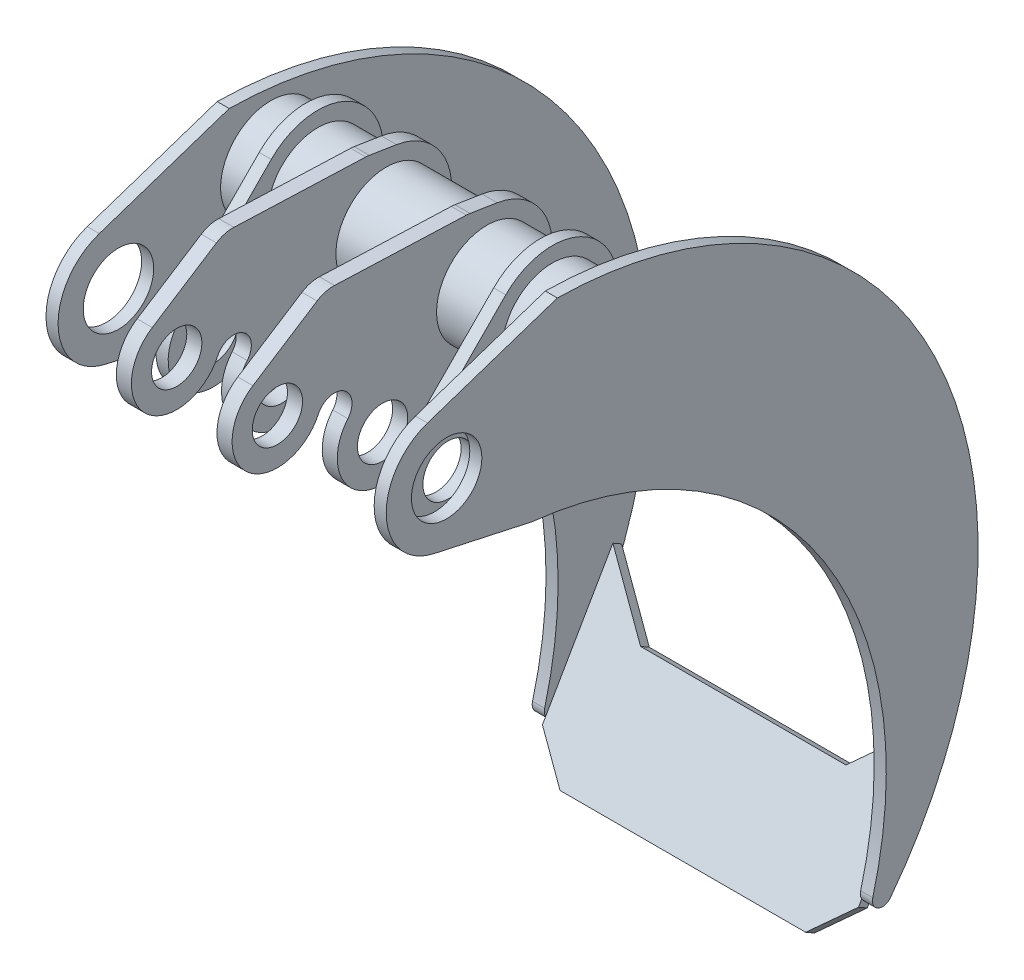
ISO-10303-21;
HEADER;
FILE_DESCRIPTION(('STEP AP214'),'2;1');
FILE_NAME('part.step','',(''),(''),'','','');
FILE_SCHEMA(('AUTOMOTIVE_DESIGN { 1 0 10303 214 1 1 1 1 }'));
ENDSEC;
DATA;
#1=APPLICATION_CONTEXT('core data for automotive mechanical design processes');
#2=APPLICATION_PROTOCOL_DEFINITION('international standard','automotive_design',2000,#1);
#3=PRODUCT_CONTEXT('',#1,'mechanical');
#4=PRODUCT('Part','Part','',(#3));
#5=PRODUCT_RELATED_PRODUCT_CATEGORY('part','',(#4));
#6=PRODUCT_DEFINITION_FORMATION('','',#4);
#7=PRODUCT_DEFINITION_CONTEXT('part definition',#1,'design');
#8=PRODUCT_DEFINITION('design','',#6,#7);
#9=PRODUCT_DEFINITION_SHAPE('','',#8);
#10=(LENGTH_UNIT() NAMED_UNIT(*) SI_UNIT(.MILLI.,.METRE.));
#11=(NAMED_UNIT(*) PLANE_ANGLE_UNIT() SI_UNIT($,.RADIAN.));
#12=(NAMED_UNIT(*) SI_UNIT($,.STERADIAN.) SOLID_ANGLE_UNIT());
#13=UNCERTAINTY_MEASURE_WITH_UNIT(LENGTH_MEASURE(1.E-05),#10,'distance_accuracy_value','');
#14=(GEOMETRIC_REPRESENTATION_CONTEXT(3) GLOBAL_UNCERTAINTY_ASSIGNED_CONTEXT((#13)) GLOBAL_UNIT_ASSIGNED_CONTEXT((#10,
#11,#12)) REPRESENTATION_CONTEXT('',''));
#15=CARTESIAN_POINT('',(0.,0.,0.));
#16=DIRECTION('',(0.,0.,1.));
#17=DIRECTION('',(1.,0.,0.));
#18=AXIS2_PLACEMENT_3D('',#15,#16,#17);
#19=CARTESIAN_POINT('',(338.002,36.129613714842,-151.484516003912));
#20=DIRECTION('',(-1.,0.,0.));
#21=DIRECTION('',(0.,0.,1.));
#22=AXIS2_PLACEMENT_3D('',#19,#20,#21);
#23=CYLINDRICAL_SURFACE('',#22,50.);
#24=CARTESIAN_POINT('',(12.,36.129613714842,-151.484516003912));
#25=DIRECTION('',(1.,0.,0.));
#26=DIRECTION('',(0.,0.,-1.));
#27=AXIS2_PLACEMENT_3D('',#24,#25,#26);
#28=CIRCLE('',#27,50.);
#29=CARTESIAN_POINT('',(12.,36.129613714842,-201.484516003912));
#30=VERTEX_POINT('',#29);
#31=EDGE_CURVE('E611',#30,#30,#28,.T.);
#32=ORIENTED_EDGE('',*,*,#31,.T.);
#33=EDGE_LOOP('',(#32));
#34=FACE_BOUND('',#33,.T.);
#35=CARTESIAN_POINT('',(46.5,36.129613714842,-151.484516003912));
#36=DIRECTION('',(1.,0.,0.));
#37=DIRECTION('',(0.,0.,-1.));
#38=AXIS2_PLACEMENT_3D('',#35,#36,#37);
#39=CIRCLE('',#38,50.);
#40=CARTESIAN_POINT('',(46.5,36.129613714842,-201.484516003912));
#41=VERTEX_POINT('',#40);
#42=EDGE_CURVE('E12',#41,#41,#39,.T.);
#43=ORIENTED_EDGE('',*,*,#42,.F.);
#44=EDGE_LOOP('',(#43));
#45=FACE_BOUND('',#44,.T.);
#46=ADVANCED_FACE('F41',(#34,#45),#23,.T.);
#47=CARTESIAN_POINT('',(58.5,36.129613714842,-151.484516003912));
#48=DIRECTION('',(-1.,0.,0.));
#49=DIRECTION('',(0.,0.,1.));
#50=AXIS2_PLACEMENT_3D('',#47,#48,#49);
#51=CIRCLE('',#50,50.);
#52=CARTESIAN_POINT('',(58.5,36.129613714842,-101.484516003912));
#53=VERTEX_POINT('',#52);
#54=EDGE_CURVE('E397',#53,#53,#51,.T.);
#55=ORIENTED_EDGE('',*,*,#54,.F.);
#56=EDGE_LOOP('',(#55));
#57=FACE_BOUND('',#56,.T.);
#58=CARTESIAN_POINT('',(111.5,36.129613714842,-151.484516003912));
#59=DIRECTION('',(1.,0.,0.));
#60=DIRECTION('',(0.,0.,-1.));
#61=AXIS2_PLACEMENT_3D('',#58,#59,#60);
#62=CIRCLE('',#61,50.);
#63=CARTESIAN_POINT('',(111.5,36.129613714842,-201.484516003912));
#64=VERTEX_POINT('',#63);
#65=EDGE_CURVE('E50',#64,#64,#62,.T.);
#66=ORIENTED_EDGE('',*,*,#65,.F.);
#67=EDGE_LOOP('',(#66));
#68=FACE_BOUND('',#67,.T.);
#69=ADVANCED_FACE('F819',(#57,#68),#23,.T.);
#70=CARTESIAN_POINT('',(326.,36.129613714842,-151.484516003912));
#71=DIRECTION('',(1.,0.,0.));
#72=DIRECTION('',(0.,0.,-1.));
#73=AXIS2_PLACEMENT_3D('',#70,#71,#72);
#74=CIRCLE('',#73,50.);
#75=CARTESIAN_POINT('',(326.,36.129613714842,-201.484516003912));
#76=VERTEX_POINT('',#75);
#77=EDGE_CURVE('E802',#76,#76,#74,.F.);
#78=ORIENTED_EDGE('',*,*,#77,.T.);
#79=EDGE_LOOP('',(#78));
#80=FACE_BOUND('',#79,.T.);
#81=CARTESIAN_POINT('',(291.5,36.129613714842,-151.484516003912));
#82=DIRECTION('',(-1.,0.,0.));
#83=DIRECTION('',(0.,0.,1.));
#84=AXIS2_PLACEMENT_3D('',#81,#82,#83);
#85=CIRCLE('',#84,50.);
#86=CARTESIAN_POINT('',(291.5,36.129613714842,-101.484516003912));
#87=VERTEX_POINT('',#86);
#88=EDGE_CURVE('E811',#87,#87,#85,.T.);
#89=ORIENTED_EDGE('',*,*,#88,.F.);
#90=EDGE_LOOP('',(#89));
#91=FACE_BOUND('',#90,.T.);
#92=ADVANCED_FACE('F821',(#80,#91),#23,.T.);
#93=CARTESIAN_POINT('',(279.5,36.129613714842,-151.484516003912));
#94=DIRECTION('',(-1.,0.,0.));
#95=DIRECTION('',(0.,0.,1.));
#96=AXIS2_PLACEMENT_3D('',#93,#94,#95);
#97=CIRCLE('',#96,50.);
#98=CARTESIAN_POINT('',(279.5,36.129613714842,-101.484516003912));
#99=VERTEX_POINT('',#98);
#100=EDGE_CURVE('E498',#99,#99,#97,.T.);
#101=ORIENTED_EDGE('',*,*,#100,.T.);
#102=EDGE_LOOP('',(#101));
#103=FACE_BOUND('',#102,.T.);
#104=CARTESIAN_POINT('',(226.5,36.129613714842,-151.484516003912));
#105=DIRECTION('',(-1.,0.,0.));
#106=DIRECTION('',(0.,0.,1.));
#107=AXIS2_PLACEMENT_3D('',#104,#105,#106);
#108=CIRCLE('',#107,50.);
#109=CARTESIAN_POINT('',(226.5,36.129613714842,-101.484516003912));
#110=VERTEX_POINT('',#109);
#111=EDGE_CURVE('E808',#110,#110,#108,.T.);
#112=ORIENTED_EDGE('',*,*,#111,.F.);
#113=EDGE_LOOP('',(#112));
#114=FACE_BOUND('',#113,.T.);
#115=ADVANCED_FACE('F828',(#103,#114),#23,.T.);
#116=CARTESIAN_POINT('',(326.,-621.049912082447,-412.330127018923));
#117=DIRECTION('',(0.,0.499999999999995,0.866025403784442));
#118=DIRECTION('',(0.,-0.866025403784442,0.499999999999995));
#119=AXIS2_PLACEMENT_3D('',#116,#117,#118);
#120=PLANE('',#119);
#121=DIRECTION('',(0.707106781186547,0.612372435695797,-0.35355339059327));
#122=VECTOR('',#121,1.);
#123=CARTESIAN_POINT('',(326.,-469.49546642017,-499.830127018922));
#124=LINE('',#123,#122);
#125=CARTESIAN_POINT('',(271.,-517.126863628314,-472.330127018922));
#126=VERTEX_POINT('',#125);
#127=CARTESIAN_POINT('',(326.,-469.49546642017,-499.830127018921));
#128=VERTEX_POINT('',#127);
#129=EDGE_CURVE('E634',#126,#128,#124,.T.);
#130=ORIENTED_EDGE('',*,*,#129,.T.);
#131=DIRECTION('',(0.,0.866025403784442,-0.499999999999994));
#132=VECTOR('',#131,1.);
#133=CARTESIAN_POINT('',(326.,-621.049912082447,-412.330127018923));
#134=LINE('',#133,#132);
#135=CARTESIAN_POINT('',(326.,-585.248641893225,-433.));
#136=VERTEX_POINT('',#135);
#137=EDGE_CURVE('E712',#136,#128,#134,.T.);
#138=ORIENTED_EDGE('',*,*,#137,.F.);
#139=CARTESIAN_POINT('',(326.,-590.739022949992,-429.830127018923));
#140=VERTEX_POINT('',#139);
#141=EDGE_CURVE('E709',#140,#136,#134,.T.);
#142=ORIENTED_EDGE('',*,*,#141,.F.);
#143=DIRECTION('',(0.707106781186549,0.612372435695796,-0.353553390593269));
#144=VECTOR('',#143,1.);
#145=CARTESIAN_POINT('',(325.999999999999,-590.739022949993,-429.830127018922));
#146=LINE('',#145,#144);
#147=CARTESIAN_POINT('',(291.,-621.049912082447,-412.330127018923));
#148=VERTEX_POINT('',#147);
#149=EDGE_CURVE('E791',#140,#148,#146,.F.);
#150=ORIENTED_EDGE('',*,*,#149,.T.);
#151=DIRECTION('',(-1.,0.,0.));
#152=VECTOR('',#151,1.);
#153=CARTESIAN_POINT('',(326.,-621.049912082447,-412.330127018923));
#154=LINE('',#153,#152);
#155=CARTESIAN_POINT('',(47.0000000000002,-621.049912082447,-412.330127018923));
#156=VERTEX_POINT('',#155);
#157=EDGE_CURVE('E730',#148,#156,#154,.T.);
#158=ORIENTED_EDGE('',*,*,#157,.T.);
#159=DIRECTION('',(-0.707106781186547,0.612372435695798,-0.35355339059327));
#160=VECTOR('',#159,1.);
#161=CARTESIAN_POINT('',(47.0000000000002,-621.049912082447,-412.330127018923));
#162=LINE('',#161,#160);
#163=CARTESIAN_POINT('',(12.,-590.739022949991,-429.830127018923));
#164=VERTEX_POINT('',#163);
#165=EDGE_CURVE('E793',#156,#164,#162,.T.);
#166=ORIENTED_EDGE('',*,*,#165,.T.);
#167=DIRECTION('',(0.,0.866025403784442,-0.499999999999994));
#168=VECTOR('',#167,1.);
#169=CARTESIAN_POINT('',(12.,-621.049912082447,-412.330127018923));
#170=LINE('',#169,#168);
#171=CARTESIAN_POINT('',(12.,-585.248641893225,-433.));
#172=VERTEX_POINT('',#171);
#173=EDGE_CURVE('E708',#164,#172,#170,.T.);
#174=ORIENTED_EDGE('',*,*,#173,.T.);
#175=CARTESIAN_POINT('',(12.,-469.49546642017,-499.830127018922));
#176=VERTEX_POINT('',#175);
#177=EDGE_CURVE('E722',#172,#176,#170,.T.);
#178=ORIENTED_EDGE('',*,*,#177,.T.);
#179=DIRECTION('',(0.707106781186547,-0.612372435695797,0.35355339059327));
#180=VECTOR('',#179,1.);
#181=CARTESIAN_POINT('',(66.9999999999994,-517.126863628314,-472.330127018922));
#182=LINE('',#181,#180);
#183=CARTESIAN_POINT('',(66.9999999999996,-517.126863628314,-472.330127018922));
#184=VERTEX_POINT('',#183);
#185=EDGE_CURVE('E641',#176,#184,#182,.T.);
#186=ORIENTED_EDGE('',*,*,#185,.T.);
#187=DIRECTION('',(1.,0.,0.));
#188=VECTOR('',#187,1.);
#189=CARTESIAN_POINT('',(271.,-517.126863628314,-472.330127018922));
#190=LINE('',#189,#188);
#191=EDGE_CURVE('E645',#184,#126,#190,.T.);
#192=ORIENTED_EDGE('',*,*,#191,.T.);
#193=EDGE_LOOP('',(#130,#138,#142,#150,#158,#166,#174,#178,#186,#192));
#194=FACE_BOUND('',#193,.T.);
#195=ADVANCED_FACE('F902',(#194),#120,.F.);
#196=CARTESIAN_POINT('',(326.,-616.049912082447,-403.669872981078));
#197=DIRECTION('',(0.,-0.499999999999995,-0.866025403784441));
#198=DIRECTION('',(0.,0.866025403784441,-0.499999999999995));
#199=AXIS2_PLACEMENT_3D('',#196,#197,#198);
#200=PLANE('',#199);
#201=DIRECTION('',(0.707106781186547,-0.612372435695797,0.35355339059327));
#202=VECTOR('',#201,1.);
#203=CARTESIAN_POINT('',(66.9999999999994,-512.126863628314,-463.669872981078));
#204=LINE('',#203,#202);
#205=CARTESIAN_POINT('',(12.,-464.49546642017,-491.169872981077));
#206=VERTEX_POINT('',#205);
#207=CARTESIAN_POINT('',(66.9999999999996,-512.126863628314,-463.669872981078));
#208=VERTEX_POINT('',#207);
#209=EDGE_CURVE('E639',#206,#208,#204,.T.);
#210=ORIENTED_EDGE('',*,*,#209,.F.);
#211=DIRECTION('',(0.,-0.866025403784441,0.499999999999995));
#212=VECTOR('',#211,1.);
#213=CARTESIAN_POINT('',(12.,-616.049912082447,-403.669872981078));
#214=LINE('',#213,#212);
#215=CARTESIAN_POINT('',(12.,-580.248641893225,-424.339745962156));
#216=VERTEX_POINT('',#215);
#217=EDGE_CURVE('E725',#206,#216,#214,.T.);
#218=ORIENTED_EDGE('',*,*,#217,.T.);
#219=CARTESIAN_POINT('',(12.,-585.739022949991,-421.169872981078));
#220=VERTEX_POINT('',#219);
#221=EDGE_CURVE('E724',#216,#220,#214,.T.);
#222=ORIENTED_EDGE('',*,*,#221,.T.);
#223=DIRECTION('',(0.707106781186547,-0.612372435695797,0.353553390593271));
#224=VECTOR('',#223,1.);
#225=CARTESIAN_POINT('',(47.0000000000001,-616.049912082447,-403.669872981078));
#226=LINE('',#225,#224);
#227=CARTESIAN_POINT('',(47.0000000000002,-616.049912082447,-403.669872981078));
#228=VERTEX_POINT('',#227);
#229=EDGE_CURVE('E797',#220,#228,#226,.T.);
#230=ORIENTED_EDGE('',*,*,#229,.T.);
#231=DIRECTION('',(-1.,0.,0.));
#232=VECTOR('',#231,1.);
#233=CARTESIAN_POINT('',(326.,-616.049912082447,-403.669872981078));
#234=LINE('',#233,#232);
#235=CARTESIAN_POINT('',(291.,-616.049912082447,-403.669872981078));
#236=VERTEX_POINT('',#235);
#237=EDGE_CURVE('E719',#236,#228,#234,.T.);
#238=ORIENTED_EDGE('',*,*,#237,.F.);
#239=DIRECTION('',(-0.707106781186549,-0.612372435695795,0.35355339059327));
#240=VECTOR('',#239,1.);
#241=CARTESIAN_POINT('',(325.999999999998,-585.739022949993,-421.169872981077));
#242=LINE('',#241,#240);
#243=CARTESIAN_POINT('',(326.,-585.739022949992,-421.169872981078));
#244=VERTEX_POINT('',#243);
#245=EDGE_CURVE('E57',#236,#244,#242,.F.);
#246=ORIENTED_EDGE('',*,*,#245,.T.);
#247=DIRECTION('',(0.,-0.866025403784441,0.499999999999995));
#248=VECTOR('',#247,1.);
#249=CARTESIAN_POINT('',(326.,-616.049912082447,-403.669872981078));
#250=LINE('',#249,#248);
#251=CARTESIAN_POINT('',(326.,-580.248641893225,-424.339745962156));
#252=VERTEX_POINT('',#251);
#253=EDGE_CURVE('E715',#252,#244,#250,.T.);
#254=ORIENTED_EDGE('',*,*,#253,.F.);
#255=CARTESIAN_POINT('',(326.,-464.49546642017,-491.169872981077));
#256=VERTEX_POINT('',#255);
#257=EDGE_CURVE('E716',#256,#252,#250,.T.);
#258=ORIENTED_EDGE('',*,*,#257,.F.);
#259=DIRECTION('',(0.707106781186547,0.612372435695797,-0.35355339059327));
#260=VECTOR('',#259,1.);
#261=CARTESIAN_POINT('',(326.,-464.49546642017,-491.169872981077));
#262=LINE('',#261,#260);
#263=CARTESIAN_POINT('',(271.,-512.126863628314,-463.669872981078));
#264=VERTEX_POINT('',#263);
#265=EDGE_CURVE('E635',#264,#256,#262,.T.);
#266=ORIENTED_EDGE('',*,*,#265,.F.);
#267=DIRECTION('',(1.,0.,0.));
#268=VECTOR('',#267,1.);
#269=CARTESIAN_POINT('',(271.,-512.126863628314,-463.669872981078));
#270=LINE('',#269,#268);
#271=EDGE_CURVE('E638',#208,#264,#270,.T.);
#272=ORIENTED_EDGE('',*,*,#271,.F.);
#273=EDGE_LOOP('',(#210,#218,#222,#230,#238,#246,#254,#258,#266,#272));
#274=FACE_BOUND('',#273,.T.);
#275=ADVANCED_FACE('F898',(#274),#200,.F.);
#276=CARTESIAN_POINT('',(12.,0.,0.));
#277=DIRECTION('',(1.,0.,0.));
#278=DIRECTION('',(0.,0.,-1.));
#279=AXIS2_PLACEMENT_3D('',#276,#277,#278);
#280=PLANE('',#279);
#281=ORIENTED_EDGE('',*,*,#31,.F.);
#282=EDGE_LOOP('',(#281));
#283=FACE_BOUND('',#282,.T.);
#284=ORIENTED_EDGE('',*,*,#217,.F.);
#285=DIRECTION('',(0.,0.499999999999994,0.866025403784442));
#286=VECTOR('',#285,1.);
#287=CARTESIAN_POINT('',(12.,-469.49546642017,-499.830127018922));
#288=LINE('',#287,#286);
#289=EDGE_CURVE('E721',#176,#206,#288,.T.);
#290=ORIENTED_EDGE('',*,*,#289,.F.);
#291=ORIENTED_EDGE('',*,*,#177,.F.);
#292=CARTESIAN_POINT('',(12.,-575.248641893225,-433.));
#293=DIRECTION('',(1.,0.,0.));
#294=DIRECTION('',(0.,0.,-1.));
#295=AXIS2_PLACEMENT_3D('',#292,#293,#294);
#296=CIRCLE('',#295,10.);
#297=CARTESIAN_POINT('',(12.,-581.318479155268,-440.947142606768));
#298=VERTEX_POINT('',#297);
#299=EDGE_CURVE('E748',#172,#298,#296,.T.);
#300=ORIENTED_EDGE('',*,*,#299,.T.);
#301=CARTESIAN_POINT('',(12.,-323.957379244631,-103.988296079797));
#302=DIRECTION('',(1.,0.,0.));
#303=DIRECTION('',(0.,0.,1.));
#304=AXIS2_PLACEMENT_3D('',#301,#302,#303);
#305=CIRCLE('',#304,424.);
#306=CARTESIAN_POINT('',(12.,100.,-110.));
#307=VERTEX_POINT('',#306);
#308=EDGE_CURVE('E752',#298,#307,#305,.T.);
#309=ORIENTED_EDGE('',*,*,#308,.T.);
#310=DIRECTION('',(0.,-0.316808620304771,0.948489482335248));
#311=VECTOR('',#310,1.);
#312=CARTESIAN_POINT('',(12.,56.9093689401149,19.0085172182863));
#313=LINE('',#312,#311);
#314=CARTESIAN_POINT('',(12.,56.9093689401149,19.0085172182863));
#315=VERTEX_POINT('',#314);
#316=EDGE_CURVE('E755',#307,#315,#313,.T.);
#317=ORIENTED_EDGE('',*,*,#316,.T.);
#318=CARTESIAN_POINT('',(12.,0.,0.));
#319=DIRECTION('',(1.,0.,0.));
#320=DIRECTION('',(0.,0.,-1.));
#321=AXIS2_PLACEMENT_3D('',#318,#319,#320);
#322=CIRCLE('',#321,60.);
#323=CARTESIAN_POINT('',(12.,-58.6155671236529,12.8146514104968));
#324=VERTEX_POINT('',#323);
#325=EDGE_CURVE('E740',#315,#324,#322,.T.);
#326=ORIENTED_EDGE('',*,*,#325,.T.);
#327=DIRECTION('',(0.,-0.21357752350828,-0.976926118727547));
#328=VECTOR('',#327,1.);
#329=CARTESIAN_POINT('',(12.,-80.,-85.));
#330=LINE('',#329,#328);
#331=CARTESIAN_POINT('',(12.,-80.,-85.));
#332=VERTEX_POINT('',#331);
#333=EDGE_CURVE('E743',#324,#332,#330,.T.);
#334=ORIENTED_EDGE('',*,*,#333,.T.);
#335=CARTESIAN_POINT('',(12.,-470.830483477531,-43.7624784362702));
#336=DIRECTION('',(-1.,0.,0.));
#337=DIRECTION('',(0.,0.,-1.));
#338=AXIS2_PLACEMENT_3D('',#335,#336,#337);
#339=CIRCLE('',#338,393.);
#340=CARTESIAN_POINT('',(12.,-572.657620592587,-423.341500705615));
#341=VERTEX_POINT('',#340);
#342=EDGE_CURVE('E746',#332,#341,#339,.T.);
#343=ORIENTED_EDGE('',*,*,#342,.T.);
#344=EDGE_CURVE('E749',#341,#216,#296,.T.);
#345=ORIENTED_EDGE('',*,*,#344,.T.);
#346=EDGE_LOOP('',(#284,#290,#291,#300,#309,#317,#326,#334,#343,#345));
#347=FACE_BOUND('',#346,.T.);
#348=CARTESIAN_POINT('',(12.,0.,0.));
#349=DIRECTION('',(1.,0.,0.));
#350=DIRECTION('',(0.,0.,-1.));
#351=AXIS2_PLACEMENT_3D('',#348,#349,#350);
#352=CIRCLE('',#351,35.);
#353=CARTESIAN_POINT('',(12.,0.,-35.));
#354=VERTEX_POINT('',#353);
#355=EDGE_CURVE('E734',#354,#354,#352,.T.);
#356=ORIENTED_EDGE('',*,*,#355,.F.);
#357=EDGE_LOOP('',(#356));
#358=FACE_BOUND('',#357,.T.);
#359=ADVANCED_FACE('F901',(#283,#347,#358),#280,.T.);
#360=CARTESIAN_POINT('',(0.,0.,0.));
#361=DIRECTION('',(1.,0.,0.));
#362=DIRECTION('',(0.,0.,-1.));
#363=AXIS2_PLACEMENT_3D('',#360,#361,#362);
#364=PLANE('',#363);
#365=CARTESIAN_POINT('',(0.,0.,0.));
#366=DIRECTION('',(1.,0.,0.));
#367=DIRECTION('',(0.,0.,-1.));
#368=AXIS2_PLACEMENT_3D('',#365,#366,#367);
#369=CIRCLE('',#368,60.);
#370=CARTESIAN_POINT('',(0.,56.9093689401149,19.0085172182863));
#371=VERTEX_POINT('',#370);
#372=CARTESIAN_POINT('',(0.,-58.6155671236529,12.8146514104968));
#373=VERTEX_POINT('',#372);
#374=EDGE_CURVE('E737',#371,#373,#369,.T.);
#375=ORIENTED_EDGE('',*,*,#374,.F.);
#376=DIRECTION('',(0.,-0.316808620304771,0.948489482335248));
#377=VECTOR('',#376,1.);
#378=CARTESIAN_POINT('',(0.,56.9093689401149,19.0085172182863));
#379=LINE('',#378,#377);
#380=CARTESIAN_POINT('',(0.,100.,-110.));
#381=VERTEX_POINT('',#380);
#382=EDGE_CURVE('E744',#381,#371,#379,.T.);
#383=ORIENTED_EDGE('',*,*,#382,.F.);
#384=CARTESIAN_POINT('',(0.,-323.957379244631,-103.988296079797));
#385=DIRECTION('',(1.,0.,0.));
#386=DIRECTION('',(0.,0.,1.));
#387=AXIS2_PLACEMENT_3D('',#384,#385,#386);
#388=CIRCLE('',#387,424.);
#389=CARTESIAN_POINT('',(0.,-581.318479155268,-440.947142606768));
#390=VERTEX_POINT('',#389);
#391=EDGE_CURVE('E766',#390,#381,#388,.T.);
#392=ORIENTED_EDGE('',*,*,#391,.F.);
#393=CARTESIAN_POINT('',(0.,-575.248641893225,-433.));
#394=DIRECTION('',(1.,0.,0.));
#395=DIRECTION('',(0.,0.,-1.));
#396=AXIS2_PLACEMENT_3D('',#393,#394,#395);
#397=CIRCLE('',#396,10.);
#398=CARTESIAN_POINT('',(0.,-572.657620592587,-423.341500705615));
#399=VERTEX_POINT('',#398);
#400=EDGE_CURVE('E764',#399,#390,#397,.T.);
#401=ORIENTED_EDGE('',*,*,#400,.F.);
#402=CARTESIAN_POINT('',(0.,-470.830483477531,-43.7624784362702));
#403=DIRECTION('',(-1.,0.,0.));
#404=DIRECTION('',(0.,0.,-1.));
#405=AXIS2_PLACEMENT_3D('',#402,#403,#404);
#406=CIRCLE('',#405,393.);
#407=CARTESIAN_POINT('',(0.,-80.,-85.));
#408=VERTEX_POINT('',#407);
#409=EDGE_CURVE('E762',#408,#399,#406,.T.);
#410=ORIENTED_EDGE('',*,*,#409,.F.);
#411=DIRECTION('',(0.,-0.21357752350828,-0.976926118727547));
#412=VECTOR('',#411,1.);
#413=CARTESIAN_POINT('',(0.,-80.,-85.));
#414=LINE('',#413,#412);
#415=EDGE_CURVE('E760',#373,#408,#414,.T.);
#416=ORIENTED_EDGE('',*,*,#415,.F.);
#417=EDGE_LOOP('',(#375,#383,#392,#401,#410,#416));
#418=FACE_BOUND('',#417,.T.);
#419=CARTESIAN_POINT('',(0.,0.,0.));
#420=DIRECTION('',(1.,0.,0.));
#421=DIRECTION('',(0.,0.,-1.));
#422=AXIS2_PLACEMENT_3D('',#419,#420,#421);
#423=CIRCLE('',#422,35.);
#424=CARTESIAN_POINT('',(0.,0.,-35.));
#425=VERTEX_POINT('',#424);
#426=EDGE_CURVE('E733',#425,#425,#423,.T.);
#427=ORIENTED_EDGE('',*,*,#426,.T.);
#428=EDGE_LOOP('',(#427));
#429=FACE_BOUND('',#428,.T.);
#430=ADVANCED_FACE('F916',(#418,#429),#364,.F.);
#431=CARTESIAN_POINT('',(12.,0.,0.));
#432=DIRECTION('',(-1.,0.,0.));
#433=DIRECTION('',(0.,0.,1.));
#434=AXIS2_PLACEMENT_3D('',#431,#432,#433);
#435=CYLINDRICAL_SURFACE('',#434,60.);
#436=ORIENTED_EDGE('',*,*,#374,.T.);
#437=DIRECTION('',(-1.,0.,0.));
#438=VECTOR('',#437,1.);
#439=CARTESIAN_POINT('',(12.,-58.6155671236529,12.8146514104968));
#440=LINE('',#439,#438);
#441=EDGE_CURVE('E783',#324,#373,#440,.T.);
#442=ORIENTED_EDGE('',*,*,#441,.F.);
#443=ORIENTED_EDGE('',*,*,#325,.F.);
#444=DIRECTION('',(-1.,0.,0.));
#445=VECTOR('',#444,1.);
#446=CARTESIAN_POINT('',(12.,56.9093689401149,19.0085172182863));
#447=LINE('',#446,#445);
#448=EDGE_CURVE('E757',#315,#371,#447,.T.);
#449=ORIENTED_EDGE('',*,*,#448,.T.);
#450=EDGE_LOOP('',(#436,#442,#443,#449));
#451=FACE_BOUND('',#450,.T.);
#452=ADVANCED_FACE('F921',(#451),#435,.T.);
#453=CARTESIAN_POINT('',(12.,-80.,-85.));
#454=DIRECTION('',(0.,0.976926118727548,-0.21357752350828));
#455=DIRECTION('',(0.,0.21357752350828,0.976926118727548));
#456=AXIS2_PLACEMENT_3D('',#453,#454,#455);
#457=PLANE('',#456);
#458=ORIENTED_EDGE('',*,*,#415,.T.);
#459=DIRECTION('',(-1.,0.,0.));
#460=VECTOR('',#459,1.);
#461=CARTESIAN_POINT('',(12.,-80.,-85.));
#462=LINE('',#461,#460);
#463=EDGE_CURVE('E780',#332,#408,#462,.T.);
#464=ORIENTED_EDGE('',*,*,#463,.F.);
#465=ORIENTED_EDGE('',*,*,#333,.F.);
#466=ORIENTED_EDGE('',*,*,#441,.T.);
#467=EDGE_LOOP('',(#458,#464,#465,#466));
#468=FACE_BOUND('',#467,.T.);
#469=ADVANCED_FACE('F937',(#468),#457,.F.);
#470=CARTESIAN_POINT('',(12.,-470.830483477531,-43.7624784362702));
#471=DIRECTION('',(-1.,0.,0.));
#472=DIRECTION('',(0.,0.,1.));
#473=AXIS2_PLACEMENT_3D('',#470,#471,#472);
#474=CYLINDRICAL_SURFACE('',#473,393.);
#475=ORIENTED_EDGE('',*,*,#409,.T.);
#476=DIRECTION('',(-1.,0.,0.));
#477=VECTOR('',#476,1.);
#478=CARTESIAN_POINT('',(12.,-572.657620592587,-423.341500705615));
#479=LINE('',#478,#477);
#480=EDGE_CURVE('E777',#341,#399,#479,.T.);
#481=ORIENTED_EDGE('',*,*,#480,.F.);
#482=ORIENTED_EDGE('',*,*,#342,.F.);
#483=ORIENTED_EDGE('',*,*,#463,.T.);
#484=EDGE_LOOP('',(#475,#481,#482,#483));
#485=FACE_BOUND('',#484,.T.);
#486=ADVANCED_FACE('F933',(#485),#474,.F.);
#487=CARTESIAN_POINT('',(12.,-575.248641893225,-433.));
#488=DIRECTION('',(-1.,0.,0.));
#489=DIRECTION('',(0.,0.,1.));
#490=AXIS2_PLACEMENT_3D('',#487,#488,#489);
#491=CYLINDRICAL_SURFACE('',#490,10.);
#492=ORIENTED_EDGE('',*,*,#400,.T.);
#493=DIRECTION('',(-1.,0.,0.));
#494=VECTOR('',#493,1.);
#495=CARTESIAN_POINT('',(12.,-581.318479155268,-440.947142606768));
#496=LINE('',#495,#494);
#497=EDGE_CURVE('E774',#298,#390,#496,.T.);
#498=ORIENTED_EDGE('',*,*,#497,.F.);
#499=ORIENTED_EDGE('',*,*,#299,.F.);
#500=EDGE_CURVE('E753',#216,#172,#296,.T.);
#501=ORIENTED_EDGE('',*,*,#500,.F.);
#502=ORIENTED_EDGE('',*,*,#344,.F.);
#503=ORIENTED_EDGE('',*,*,#480,.T.);
#504=EDGE_LOOP('',(#492,#498,#499,#501,#502,#503));
#505=FACE_BOUND('',#504,.T.);
#506=ADVANCED_FACE('F929',(#505),#491,.T.);
#507=CARTESIAN_POINT('',(12.,-323.957379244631,-103.988296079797));
#508=DIRECTION('',(-1.,0.,0.));
#509=DIRECTION('',(0.,0.,1.));
#510=AXIS2_PLACEMENT_3D('',#507,#508,#509);
#511=CYLINDRICAL_SURFACE('',#510,424.);
#512=ORIENTED_EDGE('',*,*,#391,.T.);
#513=DIRECTION('',(-1.,0.,0.));
#514=VECTOR('',#513,1.);
#515=CARTESIAN_POINT('',(12.,100.,-110.));
#516=LINE('',#515,#514);
#517=EDGE_CURVE('E771',#307,#381,#516,.T.);
#518=ORIENTED_EDGE('',*,*,#517,.F.);
#519=ORIENTED_EDGE('',*,*,#308,.F.);
#520=ORIENTED_EDGE('',*,*,#497,.T.);
#521=EDGE_LOOP('',(#512,#518,#519,#520));
#522=FACE_BOUND('',#521,.T.);
#523=ADVANCED_FACE('F925',(#522),#511,.T.);
#524=CARTESIAN_POINT('',(12.,56.9093689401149,19.0085172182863));
#525=DIRECTION('',(0.,-0.948489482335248,-0.316808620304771));
#526=DIRECTION('',(0.,0.316808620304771,-0.948489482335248));
#527=AXIS2_PLACEMENT_3D('',#524,#525,#526);
#528=PLANE('',#527);
#529=ORIENTED_EDGE('',*,*,#382,.T.);
#530=ORIENTED_EDGE('',*,*,#448,.F.);
#531=ORIENTED_EDGE('',*,*,#316,.F.);
#532=ORIENTED_EDGE('',*,*,#517,.T.);
#533=EDGE_LOOP('',(#529,#530,#531,#532));
#534=FACE_BOUND('',#533,.T.);
#535=ADVANCED_FACE('F912',(#534),#528,.F.);
#536=CARTESIAN_POINT('',(12.,0.,0.));
#537=DIRECTION('',(-1.,0.,0.));
#538=DIRECTION('',(0.,0.,1.));
#539=AXIS2_PLACEMENT_3D('',#536,#537,#538);
#540=CYLINDRICAL_SURFACE('',#539,35.);
#541=ORIENTED_EDGE('',*,*,#355,.T.);
#542=EDGE_LOOP('',(#541));
#543=FACE_BOUND('',#542,.T.);
#544=ORIENTED_EDGE('',*,*,#426,.F.);
#545=EDGE_LOOP('',(#544));
#546=FACE_BOUND('',#545,.T.);
#547=ADVANCED_FACE('F908',(#543,#546),#540,.F.);
#548=CARTESIAN_POINT('',(326.,-621.049912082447,-412.330127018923));
#549=DIRECTION('',(0.,0.866025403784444,-0.499999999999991));
#550=DIRECTION('',(0.,0.499999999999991,0.866025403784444));
#551=AXIS2_PLACEMENT_3D('',#548,#549,#550);
#552=PLANE('',#551);
#553=ORIENTED_EDGE('',*,*,#237,.T.);
#554=DIRECTION('',(0.,-0.499999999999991,-0.866025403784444));
#555=VECTOR('',#554,1.);
#556=CARTESIAN_POINT('',(47.0000000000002,-621.049912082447,-412.330127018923));
#557=LINE('',#556,#555);
#558=EDGE_CURVE('E788',#228,#156,#557,.T.);
#559=ORIENTED_EDGE('',*,*,#558,.T.);
#560=ORIENTED_EDGE('',*,*,#157,.F.);
#561=DIRECTION('',(0.,0.499999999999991,0.866025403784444));
#562=VECTOR('',#561,1.);
#563=CARTESIAN_POINT('',(291.,-621.049912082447,-412.330127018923));
#564=LINE('',#563,#562);
#565=EDGE_CURVE('E786',#148,#236,#564,.T.);
#566=ORIENTED_EDGE('',*,*,#565,.T.);
#567=EDGE_LOOP('',(#553,#559,#560,#566));
#568=FACE_BOUND('',#567,.T.);
#569=ADVANCED_FACE('F894',(#568),#552,.F.);
#570=CARTESIAN_POINT('',(326.,0.,0.));
#571=DIRECTION('',(-1.,0.,0.));
#572=DIRECTION('',(0.,0.,1.));
#573=AXIS2_PLACEMENT_3D('',#570,#571,#572);
#574=PLANE('',#573);
#575=ORIENTED_EDGE('',*,*,#253,.T.);
#576=DIRECTION('',(0.,-0.499999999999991,-0.866025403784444));
#577=VECTOR('',#576,1.);
#578=CARTESIAN_POINT('',(326.,-256.932362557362,148.339968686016));
#579=LINE('',#578,#577);
#580=EDGE_CURVE('E799',#244,#140,#579,.T.);
#581=ORIENTED_EDGE('',*,*,#580,.T.);
#582=ORIENTED_EDGE('',*,*,#141,.T.);
#583=CARTESIAN_POINT('',(326.,-575.248641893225,-433.));
#584=DIRECTION('',(1.,0.,0.));
#585=DIRECTION('',(0.,0.,-1.));
#586=AXIS2_PLACEMENT_3D('',#583,#584,#585);
#587=CIRCLE('',#586,9.99999999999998);
#588=EDGE_CURVE('E690',#252,#136,#587,.T.);
#589=ORIENTED_EDGE('',*,*,#588,.F.);
#590=EDGE_LOOP('',(#575,#581,#582,#589));
#591=FACE_BOUND('',#590,.T.);
#592=ADVANCED_FACE('F891',(#591),#574,.F.);
#593=CARTESIAN_POINT('',(12.,0.,0.));
#594=DIRECTION('',(-1.,0.,0.));
#595=DIRECTION('',(0.,0.,1.));
#596=AXIS2_PLACEMENT_3D('',#593,#594,#595);
#597=PLANE('',#596);
#598=ORIENTED_EDGE('',*,*,#173,.F.);
#599=DIRECTION('',(0.,0.499999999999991,0.866025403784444));
#600=VECTOR('',#599,1.);
#601=CARTESIAN_POINT('',(12.,-585.739022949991,-421.169872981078));
#602=LINE('',#601,#600);
#603=EDGE_CURVE('E65',#164,#220,#602,.T.);
#604=ORIENTED_EDGE('',*,*,#603,.T.);
#605=ORIENTED_EDGE('',*,*,#221,.F.);
#606=ORIENTED_EDGE('',*,*,#500,.T.);
#607=EDGE_LOOP('',(#598,#604,#605,#606));
#608=FACE_BOUND('',#607,.T.);
#609=ADVANCED_FACE('F866',(#608),#597,.T.);
#610=CARTESIAN_POINT('',(326.,-323.957379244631,-103.988296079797));
#611=DIRECTION('',(1.,0.,0.));
#612=DIRECTION('',(0.,0.,-1.));
#613=AXIS2_PLACEMENT_3D('',#610,#611,#612);
#614=PLANE('',#613);
#615=ORIENTED_EDGE('',*,*,#77,.F.);
#616=EDGE_LOOP('',(#615));
#617=FACE_BOUND('',#616,.T.);
#618=CARTESIAN_POINT('',(326.,0.,0.));
#619=DIRECTION('',(1.,0.,0.));
#620=DIRECTION('',(0.,0.,-1.));
#621=AXIS2_PLACEMENT_3D('',#618,#619,#620);
#622=CIRCLE('',#621,35.);
#623=CARTESIAN_POINT('',(326.,0.,-35.));
#624=VERTEX_POINT('',#623);
#625=EDGE_CURVE('E655',#624,#624,#622,.T.);
#626=ORIENTED_EDGE('',*,*,#625,.T.);
#627=EDGE_LOOP('',(#626));
#628=FACE_BOUND('',#627,.T.);
#629=CARTESIAN_POINT('',(326.,-581.318479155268,-440.947142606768));
#630=VERTEX_POINT('',#629);
#631=EDGE_CURVE('E687',#136,#630,#587,.T.);
#632=ORIENTED_EDGE('',*,*,#631,.F.);
#633=ORIENTED_EDGE('',*,*,#137,.T.);
#634=DIRECTION('',(0.,0.499999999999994,0.866025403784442));
#635=VECTOR('',#634,1.);
#636=CARTESIAN_POINT('',(326.,-469.49546642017,-499.830127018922));
#637=LINE('',#636,#635);
#638=EDGE_CURVE('E711',#128,#256,#637,.T.);
#639=ORIENTED_EDGE('',*,*,#638,.T.);
#640=ORIENTED_EDGE('',*,*,#257,.T.);
#641=CARTESIAN_POINT('',(326.,-572.657620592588,-423.341500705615));
#642=VERTEX_POINT('',#641);
#643=EDGE_CURVE('E666',#642,#252,#587,.T.);
#644=ORIENTED_EDGE('',*,*,#643,.F.);
#645=CARTESIAN_POINT('',(326.,-470.830483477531,-43.7624784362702));
#646=DIRECTION('',(-1.,0.,0.));
#647=DIRECTION('',(0.,0.,-1.));
#648=AXIS2_PLACEMENT_3D('',#645,#646,#647);
#649=CIRCLE('',#648,393.);
#650=CARTESIAN_POINT('',(326.,-79.9999999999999,-85.0000000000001));
#651=VERTEX_POINT('',#650);
#652=EDGE_CURVE('E685',#651,#642,#649,.T.);
#653=ORIENTED_EDGE('',*,*,#652,.F.);
#654=DIRECTION('',(0.,-0.213577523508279,-0.976926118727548));
#655=VECTOR('',#654,1.);
#656=CARTESIAN_POINT('',(326.,-58.6155671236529,12.8146514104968));
#657=LINE('',#656,#655);
#658=CARTESIAN_POINT('',(326.,-58.6155671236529,12.8146514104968));
#659=VERTEX_POINT('',#658);
#660=EDGE_CURVE('E683',#659,#651,#657,.T.);
#661=ORIENTED_EDGE('',*,*,#660,.F.);
#662=CARTESIAN_POINT('',(326.,0.,0.));
#663=DIRECTION('',(1.,0.,0.));
#664=DIRECTION('',(0.,0.,-1.));
#665=AXIS2_PLACEMENT_3D('',#662,#663,#664);
#666=CIRCLE('',#665,60.);
#667=CARTESIAN_POINT('',(326.,56.9093689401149,19.0085172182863));
#668=VERTEX_POINT('',#667);
#669=EDGE_CURVE('E681',#668,#659,#666,.T.);
#670=ORIENTED_EDGE('',*,*,#669,.F.);
#671=DIRECTION('',(0.,-0.316808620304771,0.948489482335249));
#672=VECTOR('',#671,1.);
#673=CARTESIAN_POINT('',(326.,100.,-110.));
#674=LINE('',#673,#672);
#675=CARTESIAN_POINT('',(326.,100.,-110.));
#676=VERTEX_POINT('',#675);
#677=EDGE_CURVE('E679',#676,#668,#674,.T.);
#678=ORIENTED_EDGE('',*,*,#677,.F.);
#679=CARTESIAN_POINT('',(326.,-323.957379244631,-103.988296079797));
#680=DIRECTION('',(1.,0.,0.));
#681=DIRECTION('',(0.,0.,-1.));
#682=AXIS2_PLACEMENT_3D('',#679,#680,#681);
#683=CIRCLE('',#682,424.);
#684=EDGE_CURVE('E659',#630,#676,#683,.T.);
#685=ORIENTED_EDGE('',*,*,#684,.F.);
#686=EDGE_LOOP('',(#632,#633,#639,#640,#644,#653,#661,#670,#678,#685));
#687=FACE_BOUND('',#686,.T.);
#688=ADVANCED_FACE('F862',(#617,#628,#687),#614,.F.);
#689=CARTESIAN_POINT('',(338.,-323.957379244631,-103.988296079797));
#690=DIRECTION('',(1.,0.,0.));
#691=DIRECTION('',(0.,0.,-1.));
#692=AXIS2_PLACEMENT_3D('',#689,#690,#691);
#693=PLANE('',#692);
#694=CARTESIAN_POINT('',(338.,-323.957379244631,-103.988296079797));
#695=DIRECTION('',(1.,0.,0.));
#696=DIRECTION('',(0.,0.,-1.));
#697=AXIS2_PLACEMENT_3D('',#694,#695,#696);
#698=CIRCLE('',#697,424.);
#699=CARTESIAN_POINT('',(338.,-581.318479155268,-440.947142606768));
#700=VERTEX_POINT('',#699);
#701=CARTESIAN_POINT('',(338.,100.,-110.));
#702=VERTEX_POINT('',#701);
#703=EDGE_CURVE('E662',#700,#702,#698,.T.);
#704=ORIENTED_EDGE('',*,*,#703,.T.);
#705=DIRECTION('',(0.,-0.316808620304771,0.948489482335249));
#706=VECTOR('',#705,1.);
#707=CARTESIAN_POINT('',(338.,100.,-110.));
#708=LINE('',#707,#706);
#709=CARTESIAN_POINT('',(338.,56.9093689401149,19.0085172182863));
#710=VERTEX_POINT('',#709);
#711=EDGE_CURVE('E665',#702,#710,#708,.T.);
#712=ORIENTED_EDGE('',*,*,#711,.T.);
#713=CARTESIAN_POINT('',(338.,0.,0.));
#714=DIRECTION('',(1.,0.,0.));
#715=DIRECTION('',(0.,0.,-1.));
#716=AXIS2_PLACEMENT_3D('',#713,#714,#715);
#717=CIRCLE('',#716,60.);
#718=CARTESIAN_POINT('',(338.,-58.6155671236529,12.8146514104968));
#719=VERTEX_POINT('',#718);
#720=EDGE_CURVE('E668',#710,#719,#717,.T.);
#721=ORIENTED_EDGE('',*,*,#720,.T.);
#722=DIRECTION('',(0.,-0.213577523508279,-0.976926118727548));
#723=VECTOR('',#722,1.);
#724=CARTESIAN_POINT('',(338.,-58.6155671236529,12.8146514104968));
#725=LINE('',#724,#723);
#726=CARTESIAN_POINT('',(338.,-79.9999999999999,-85.0000000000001));
#727=VERTEX_POINT('',#726);
#728=EDGE_CURVE('E670',#719,#727,#725,.T.);
#729=ORIENTED_EDGE('',*,*,#728,.T.);
#730=CARTESIAN_POINT('',(338.,-470.830483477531,-43.7624784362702));
#731=DIRECTION('',(-1.,0.,0.));
#732=DIRECTION('',(0.,0.,-1.));
#733=AXIS2_PLACEMENT_3D('',#730,#731,#732);
#734=CIRCLE('',#733,393.);
#735=CARTESIAN_POINT('',(338.,-572.657620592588,-423.341500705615));
#736=VERTEX_POINT('',#735);
#737=EDGE_CURVE('E672',#727,#736,#734,.T.);
#738=ORIENTED_EDGE('',*,*,#737,.T.);
#739=CARTESIAN_POINT('',(338.,-575.248641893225,-433.));
#740=DIRECTION('',(1.,0.,0.));
#741=DIRECTION('',(0.,0.,-1.));
#742=AXIS2_PLACEMENT_3D('',#739,#740,#741);
#743=CIRCLE('',#742,9.99999999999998);
#744=EDGE_CURVE('E674',#736,#700,#743,.T.);
#745=ORIENTED_EDGE('',*,*,#744,.T.);
#746=EDGE_LOOP('',(#704,#712,#721,#729,#738,#745));
#747=FACE_BOUND('',#746,.T.);
#748=CARTESIAN_POINT('',(338.,0.,0.));
#749=DIRECTION('',(1.,0.,0.));
#750=DIRECTION('',(0.,0.,-1.));
#751=AXIS2_PLACEMENT_3D('',#748,#749,#750);
#752=CIRCLE('',#751,35.);
#753=CARTESIAN_POINT('',(338.,0.,-35.));
#754=VERTEX_POINT('',#753);
#755=EDGE_CURVE('E656',#754,#754,#752,.T.);
#756=ORIENTED_EDGE('',*,*,#755,.F.);
#757=EDGE_LOOP('',(#756));
#758=FACE_BOUND('',#757,.T.);
#759=ADVANCED_FACE('F858',(#747,#758),#693,.T.);
#760=CARTESIAN_POINT('',(338.,-323.957379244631,-103.988296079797));
#761=DIRECTION('',(-1.,0.,0.));
#762=DIRECTION('',(0.,0.,1.));
#763=AXIS2_PLACEMENT_3D('',#760,#761,#762);
#764=CYLINDRICAL_SURFACE('',#763,424.);
#765=ORIENTED_EDGE('',*,*,#684,.T.);
#766=DIRECTION('',(-1.,0.,0.));
#767=VECTOR('',#766,1.);
#768=CARTESIAN_POINT('',(338.,100.,-110.));
#769=LINE('',#768,#767);
#770=EDGE_CURVE('E705',#702,#676,#769,.T.);
#771=ORIENTED_EDGE('',*,*,#770,.F.);
#772=ORIENTED_EDGE('',*,*,#703,.F.);
#773=DIRECTION('',(-1.,0.,0.));
#774=VECTOR('',#773,1.);
#775=CARTESIAN_POINT('',(338.,-581.318479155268,-440.947142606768));
#776=LINE('',#775,#774);
#777=EDGE_CURVE('E676',#700,#630,#776,.T.);
#778=ORIENTED_EDGE('',*,*,#777,.T.);
#779=EDGE_LOOP('',(#765,#771,#772,#778));
#780=FACE_BOUND('',#779,.T.);
#781=ADVANCED_FACE('F861',(#780),#764,.T.);
#782=CARTESIAN_POINT('',(338.,100.,-110.));
#783=DIRECTION('',(0.,-0.948489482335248,-0.316808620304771));
#784=DIRECTION('',(0.,0.316808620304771,-0.948489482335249));
#785=AXIS2_PLACEMENT_3D('',#782,#783,#784);
#786=PLANE('',#785);
#787=ORIENTED_EDGE('',*,*,#677,.T.);
#788=DIRECTION('',(-1.,0.,0.));
#789=VECTOR('',#788,1.);
#790=CARTESIAN_POINT('',(338.,56.9093689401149,19.0085172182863));
#791=LINE('',#790,#789);
#792=EDGE_CURVE('E702',#710,#668,#791,.T.);
#793=ORIENTED_EDGE('',*,*,#792,.F.);
#794=ORIENTED_EDGE('',*,*,#711,.F.);
#795=ORIENTED_EDGE('',*,*,#770,.T.);
#796=EDGE_LOOP('',(#787,#793,#794,#795));
#797=FACE_BOUND('',#796,.T.);
#798=ADVANCED_FACE('F883',(#797),#786,.F.);
#799=CARTESIAN_POINT('',(338.,0.,0.));
#800=DIRECTION('',(-1.,0.,0.));
#801=DIRECTION('',(0.,0.,1.));
#802=AXIS2_PLACEMENT_3D('',#799,#800,#801);
#803=CYLINDRICAL_SURFACE('',#802,60.);
#804=ORIENTED_EDGE('',*,*,#669,.T.);
#805=DIRECTION('',(-1.,0.,0.));
#806=VECTOR('',#805,1.);
#807=CARTESIAN_POINT('',(338.,-58.6155671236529,12.8146514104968));
#808=LINE('',#807,#806);
#809=EDGE_CURVE('E699',#719,#659,#808,.T.);
#810=ORIENTED_EDGE('',*,*,#809,.F.);
#811=ORIENTED_EDGE('',*,*,#720,.F.);
#812=ORIENTED_EDGE('',*,*,#792,.T.);
#813=EDGE_LOOP('',(#804,#810,#811,#812));
#814=FACE_BOUND('',#813,.T.);
#815=ADVANCED_FACE('F879',(#814),#803,.T.);
#816=CARTESIAN_POINT('',(338.,-58.6155671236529,12.8146514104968));
#817=DIRECTION('',(0.,0.976926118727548,-0.213577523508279));
#818=DIRECTION('',(0.,0.213577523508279,0.976926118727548));
#819=AXIS2_PLACEMENT_3D('',#816,#817,#818);
#820=PLANE('',#819);
#821=ORIENTED_EDGE('',*,*,#660,.T.);
#822=DIRECTION('',(-1.,0.,0.));
#823=VECTOR('',#822,1.);
#824=CARTESIAN_POINT('',(338.,-79.9999999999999,-85.0000000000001));
#825=LINE('',#824,#823);
#826=EDGE_CURVE('E696',#727,#651,#825,.T.);
#827=ORIENTED_EDGE('',*,*,#826,.F.);
#828=ORIENTED_EDGE('',*,*,#728,.F.);
#829=ORIENTED_EDGE('',*,*,#809,.T.);
#830=EDGE_LOOP('',(#821,#827,#828,#829));
#831=FACE_BOUND('',#830,.T.);
#832=ADVANCED_FACE('F875',(#831),#820,.F.);
#833=CARTESIAN_POINT('',(338.,-470.830483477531,-43.7624784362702));
#834=DIRECTION('',(-1.,0.,0.));
#835=DIRECTION('',(0.,0.,1.));
#836=AXIS2_PLACEMENT_3D('',#833,#834,#835);
#837=CYLINDRICAL_SURFACE('',#836,393.);
#838=ORIENTED_EDGE('',*,*,#652,.T.);
#839=DIRECTION('',(-1.,0.,0.));
#840=VECTOR('',#839,1.);
#841=CARTESIAN_POINT('',(338.,-572.657620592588,-423.341500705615));
#842=LINE('',#841,#840);
#843=EDGE_CURVE('E693',#736,#642,#842,.T.);
#844=ORIENTED_EDGE('',*,*,#843,.F.);
#845=ORIENTED_EDGE('',*,*,#737,.F.);
#846=ORIENTED_EDGE('',*,*,#826,.T.);
#847=EDGE_LOOP('',(#838,#844,#845,#846));
#848=FACE_BOUND('',#847,.T.);
#849=ADVANCED_FACE('F871',(#848),#837,.F.);
#850=CARTESIAN_POINT('',(338.,-575.248641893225,-433.));
#851=DIRECTION('',(-1.,0.,0.));
#852=DIRECTION('',(0.,0.,1.));
#853=AXIS2_PLACEMENT_3D('',#850,#851,#852);
#854=CYLINDRICAL_SURFACE('',#853,9.99999999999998);
#855=ORIENTED_EDGE('',*,*,#643,.T.);
#856=ORIENTED_EDGE('',*,*,#588,.T.);
#857=ORIENTED_EDGE('',*,*,#631,.T.);
#858=ORIENTED_EDGE('',*,*,#777,.F.);
#859=ORIENTED_EDGE('',*,*,#744,.F.);
#860=ORIENTED_EDGE('',*,*,#843,.T.);
#861=EDGE_LOOP('',(#855,#856,#857,#858,#859,#860));
#862=FACE_BOUND('',#861,.T.);
#863=ADVANCED_FACE('F856',(#862),#854,.T.);
#864=CARTESIAN_POINT('',(338.,0.,0.));
#865=DIRECTION('',(-1.,0.,0.));
#866=DIRECTION('',(0.,0.,1.));
#867=AXIS2_PLACEMENT_3D('',#864,#865,#866);
#868=CYLINDRICAL_SURFACE('',#867,35.);
#869=ORIENTED_EDGE('',*,*,#755,.T.);
#870=EDGE_LOOP('',(#869));
#871=FACE_BOUND('',#870,.T.);
#872=ORIENTED_EDGE('',*,*,#625,.F.);
#873=EDGE_LOOP('',(#872));
#874=FACE_BOUND('',#873,.T.);
#875=ADVANCED_FACE('F852',(#871,#874),#868,.F.);
#876=CARTESIAN_POINT('',(47.0000000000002,-621.049912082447,-412.330127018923));
#877=DIRECTION('',(-0.707106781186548,-0.612372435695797,0.353553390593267));
#878=DIRECTION('',(0.,0.499999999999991,0.866025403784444));
#879=AXIS2_PLACEMENT_3D('',#876,#877,#878);
#880=PLANE('',#879);
#881=ORIENTED_EDGE('',*,*,#229,.F.);
#882=ORIENTED_EDGE('',*,*,#603,.F.);
#883=ORIENTED_EDGE('',*,*,#165,.F.);
#884=ORIENTED_EDGE('',*,*,#558,.F.);
#885=EDGE_LOOP('',(#881,#882,#883,#884));
#886=FACE_BOUND('',#885,.T.);
#887=ADVANCED_FACE('F855',(#886),#880,.T.);
#888=CARTESIAN_POINT('',(326.,-256.932362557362,148.339968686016));
#889=DIRECTION('',(-0.707106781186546,0.612372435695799,-0.353553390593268));
#890=DIRECTION('',(0.,-0.499999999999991,-0.866025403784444));
#891=AXIS2_PLACEMENT_3D('',#888,#889,#890);
#892=PLANE('',#891);
#893=ORIENTED_EDGE('',*,*,#245,.F.);
#894=ORIENTED_EDGE('',*,*,#565,.F.);
#895=ORIENTED_EDGE('',*,*,#149,.F.);
#896=ORIENTED_EDGE('',*,*,#580,.F.);
#897=EDGE_LOOP('',(#893,#894,#895,#896));
#898=FACE_BOUND('',#897,.T.);
#899=ADVANCED_FACE('F43',(#898),#892,.F.);
#900=CARTESIAN_POINT('',(326.,-1094.42829485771,-1582.24553719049));
#901=DIRECTION('',(-0.707106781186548,0.612372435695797,-0.35355339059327));
#902=DIRECTION('',(-0.654653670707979,-0.755928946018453,0.));
#903=AXIS2_PLACEMENT_3D('',#900,#901,#902);
#904=PLANE('',#903);
#905=ORIENTED_EDGE('',*,*,#129,.F.);
#906=DIRECTION('',(0.,0.499999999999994,0.866025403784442));
#907=VECTOR('',#906,1.);
#908=CARTESIAN_POINT('',(271.,-1142.05969206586,-1554.74553719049));
#909=LINE('',#908,#907);
#910=EDGE_CURVE('E652',#126,#264,#909,.T.);
#911=ORIENTED_EDGE('',*,*,#910,.T.);
#912=ORIENTED_EDGE('',*,*,#265,.T.);
#913=ORIENTED_EDGE('',*,*,#638,.F.);
#914=EDGE_LOOP('',(#905,#911,#912,#913));
#915=FACE_BOUND('',#914,.T.);
#916=ADVANCED_FACE('F847',(#915),#904,.T.);
#917=CARTESIAN_POINT('',(271.,-1142.05969206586,-1554.74553719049));
#918=DIRECTION('',(0.,0.866025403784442,-0.499999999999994));
#919=DIRECTION('',(0.,0.499999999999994,0.866025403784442));
#920=AXIS2_PLACEMENT_3D('',#917,#918,#919);
#921=PLANE('',#920);
#922=ORIENTED_EDGE('',*,*,#191,.F.);
#923=DIRECTION('',(0.,0.499999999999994,0.866025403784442));
#924=VECTOR('',#923,1.);
#925=CARTESIAN_POINT('',(66.9999999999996,-1142.05969206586,-1554.74553719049));
#926=LINE('',#925,#924);
#927=EDGE_CURVE('E637',#184,#208,#926,.T.);
#928=ORIENTED_EDGE('',*,*,#927,.T.);
#929=ORIENTED_EDGE('',*,*,#271,.T.);
#930=ORIENTED_EDGE('',*,*,#910,.F.);
#931=EDGE_LOOP('',(#922,#928,#929,#930));
#932=FACE_BOUND('',#931,.T.);
#933=ADVANCED_FACE('F843',(#932),#921,.T.);
#934=CARTESIAN_POINT('',(66.9999999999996,-1142.05969206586,-1554.74553719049));
#935=DIRECTION('',(0.707106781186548,0.612372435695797,-0.35355339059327));
#936=DIRECTION('',(-0.654653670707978,0.755928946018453,0.));
#937=AXIS2_PLACEMENT_3D('',#934,#935,#936);
#938=PLANE('',#937);
#939=ORIENTED_EDGE('',*,*,#185,.F.);
#940=ORIENTED_EDGE('',*,*,#289,.T.);
#941=ORIENTED_EDGE('',*,*,#209,.T.);
#942=ORIENTED_EDGE('',*,*,#927,.F.);
#943=EDGE_LOOP('',(#939,#940,#941,#942));
#944=FACE_BOUND('',#943,.T.);
#945=ADVANCED_FACE('F837',(#944),#938,.T.);
#946=CARTESIAN_POINT('',(126.5,36.129613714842,-151.484516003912));
#947=DIRECTION('',(1.,0.,0.));
#948=DIRECTION('',(0.,0.,-1.));
#949=AXIS2_PLACEMENT_3D('',#946,#947,#948);
#950=CIRCLE('',#949,50.);
#951=CARTESIAN_POINT('',(126.5,36.129613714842,-201.484516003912));
#952=VERTEX_POINT('',#951);
#953=EDGE_CURVE('E417',#952,#952,#950,.T.);
#954=ORIENTED_EDGE('',*,*,#953,.T.);
#955=EDGE_LOOP('',(#954));
#956=FACE_BOUND('',#955,.T.);
#957=CARTESIAN_POINT('',(211.5,36.129613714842,-151.484516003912));
#958=DIRECTION('',(1.,0.,0.));
#959=DIRECTION('',(0.,0.,-1.));
#960=AXIS2_PLACEMENT_3D('',#957,#958,#959);
#961=CIRCLE('',#960,50.);
#962=CARTESIAN_POINT('',(211.5,36.129613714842,-201.484516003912));
#963=VERTEX_POINT('',#962);
#964=EDGE_CURVE('E543',#963,#963,#961,.T.);
#965=ORIENTED_EDGE('',*,*,#964,.F.);
#966=EDGE_LOOP('',(#965));
#967=FACE_BOUND('',#966,.T.);
#968=ADVANCED_FACE('F831',(#956,#967),#23,.T.);
#969=CARTESIAN_POINT('',(211.5,0.,0.));
#970=DIRECTION('',(1.,0.,0.));
#971=DIRECTION('',(0.,0.,-1.));
#972=AXIS2_PLACEMENT_3D('',#969,#970,#971);
#973=CYLINDRICAL_SURFACE('',#972,17.5);
#974=CARTESIAN_POINT('',(226.5,0.,0.));
#975=DIRECTION('',(-1.,0.,0.));
#976=DIRECTION('',(0.,0.,1.));
#977=AXIS2_PLACEMENT_3D('',#974,#975,#976);
#978=CIRCLE('',#977,17.5);
#979=CARTESIAN_POINT('',(226.5,7.3958195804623,15.8603862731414));
#980=VERTEX_POINT('',#979);
#981=CARTESIAN_POINT('',(226.5,-11.2487831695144,-13.4057777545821));
#982=VERTEX_POINT('',#981);
#983=EDGE_CURVE('E548',#980,#982,#978,.T.);
#984=ORIENTED_EDGE('',*,*,#983,.F.);
#985=DIRECTION('',(1.,0.,0.));
#986=VECTOR('',#985,1.);
#987=CARTESIAN_POINT('',(211.5,7.3958195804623,15.8603862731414));
#988=LINE('',#987,#986);
#989=CARTESIAN_POINT('',(211.5,7.3958195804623,15.8603862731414));
#990=VERTEX_POINT('',#989);
#991=EDGE_CURVE('E609',#990,#980,#988,.T.);
#992=ORIENTED_EDGE('',*,*,#991,.F.);
#993=CARTESIAN_POINT('',(211.5,0.,0.));
#994=DIRECTION('',(-1.,0.,0.));
#995=DIRECTION('',(0.,0.,1.));
#996=AXIS2_PLACEMENT_3D('',#993,#994,#995);
#997=CIRCLE('',#996,17.5);
#998=CARTESIAN_POINT('',(211.5,-11.2487831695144,-13.4057777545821));
#999=VERTEX_POINT('',#998);
#1000=EDGE_CURVE('E549',#990,#999,#997,.T.);
#1001=ORIENTED_EDGE('',*,*,#1000,.T.);
#1002=DIRECTION('',(1.,0.,0.));
#1003=VECTOR('',#1002,1.);
#1004=CARTESIAN_POINT('',(211.5,-11.2487831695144,-13.4057777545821));
#1005=LINE('',#1004,#1003);
#1006=EDGE_CURVE('E580',#999,#982,#1005,.T.);
#1007=ORIENTED_EDGE('',*,*,#1006,.T.);
#1008=EDGE_LOOP('',(#984,#992,#1001,#1007));
#1009=FACE_BOUND('',#1008,.T.);
#1010=ADVANCED_FACE('F836',(#1009),#973,.F.);
#1011=CARTESIAN_POINT('',(211.5,26.413641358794,56.6442366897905));
#1012=DIRECTION('',(1.,0.,0.));
#1013=DIRECTION('',(0.,0.,-1.));
#1014=AXIS2_PLACEMENT_3D('',#1011,#1012,#1013);
#1015=CYLINDRICAL_SURFACE('',#1014,45.);
#1016=CARTESIAN_POINT('',(226.5,26.413641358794,56.6442366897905));
#1017=DIRECTION('',(1.,0.,0.));
#1018=DIRECTION('',(0.,0.,-1.));
#1019=AXIS2_PLACEMENT_3D('',#1016,#1017,#1018);
#1020=CIRCLE('',#1019,45.);
#1021=CARTESIAN_POINT('',(226.5,64.2729685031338,80.9685321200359));
#1022=VERTEX_POINT('',#1021);
#1023=EDGE_CURVE('E553',#1022,#980,#1020,.T.);
#1024=ORIENTED_EDGE('',*,*,#1023,.F.);
#1025=DIRECTION('',(1.,0.,0.));
#1026=VECTOR('',#1025,1.);
#1027=CARTESIAN_POINT('',(211.5,64.2729685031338,80.9685321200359));
#1028=LINE('',#1027,#1026);
#1029=CARTESIAN_POINT('',(211.5,64.2729685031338,80.9685321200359));
#1030=VERTEX_POINT('',#1029);
#1031=EDGE_CURVE('E612',#1030,#1022,#1028,.T.);
#1032=ORIENTED_EDGE('',*,*,#1031,.F.);
#1033=CARTESIAN_POINT('',(211.5,26.413641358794,56.6442366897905));
#1034=DIRECTION('',(1.,0.,0.));
#1035=DIRECTION('',(0.,0.,-1.));
#1036=AXIS2_PLACEMENT_3D('',#1033,#1034,#1035);
#1037=CIRCLE('',#1036,45.);
#1038=EDGE_CURVE('E577',#1030,#990,#1037,.T.);
#1039=ORIENTED_EDGE('',*,*,#1038,.T.);
#1040=ORIENTED_EDGE('',*,*,#991,.T.);
#1041=EDGE_LOOP('',(#1024,#1032,#1039,#1040));
#1042=FACE_BOUND('',#1041,.T.);
#1043=ADVANCED_FACE('F1044',(#1042),#1015,.T.);
#1044=CARTESIAN_POINT('',(211.5,105.2333011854,17.2161969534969));
#1045=DIRECTION('',(0.,0.841318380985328,0.540539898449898));
#1046=DIRECTION('',(0.,-0.540539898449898,0.841318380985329));
#1047=AXIS2_PLACEMENT_3D('',#1044,#1045,#1046);
#1048=PLANE('',#1047);
#1049=DIRECTION('',(0.,-0.540539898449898,0.841318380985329));
#1050=VECTOR('',#1049,1.);
#1051=CARTESIAN_POINT('',(226.5,105.2333011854,17.2161969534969));
#1052=LINE('',#1051,#1050);
#1053=CARTESIAN_POINT('',(226.5,105.2333011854,17.2161969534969));
#1054=VERTEX_POINT('',#1053);
#1055=EDGE_CURVE('E604',#1054,#1022,#1052,.T.);
#1056=ORIENTED_EDGE('',*,*,#1055,.F.);
#1057=DIRECTION('',(1.,0.,0.));
#1058=VECTOR('',#1057,1.);
#1059=CARTESIAN_POINT('',(211.5,105.2333011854,17.2161969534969));
#1060=LINE('',#1059,#1058);
#1061=CARTESIAN_POINT('',(211.5,105.2333011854,17.2161969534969));
#1062=VERTEX_POINT('',#1061);
#1063=EDGE_CURVE('E614',#1062,#1054,#1060,.T.);
#1064=ORIENTED_EDGE('',*,*,#1063,.F.);
#1065=DIRECTION('',(0.,-0.540539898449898,0.841318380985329));
#1066=VECTOR('',#1065,1.);
#1067=CARTESIAN_POINT('',(211.5,105.2333011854,17.2161969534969));
#1068=LINE('',#1067,#1066);
#1069=EDGE_CURVE('E574',#1062,#1030,#1068,.T.);
#1070=ORIENTED_EDGE('',*,*,#1069,.T.);
#1071=ORIENTED_EDGE('',*,*,#1031,.T.);
#1072=EDGE_LOOP('',(#1056,#1064,#1070,#1071));
#1073=FACE_BOUND('',#1072,.T.);
#1074=ADVANCED_FACE('F1052',(#1073),#1048,.T.);
#1075=CARTESIAN_POINT('',(211.5,79.9937497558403,1.00000000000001));
#1076=DIRECTION('',(1.,0.,0.));
#1077=DIRECTION('',(0.,0.,-1.));
#1078=AXIS2_PLACEMENT_3D('',#1075,#1076,#1077);
#1079=CYLINDRICAL_SURFACE('',#1078,30.);
#1080=CARTESIAN_POINT('',(226.5,79.9937497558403,1.00000000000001));
#1081=DIRECTION('',(1.,0.,0.));
#1082=DIRECTION('',(0.,0.,-1.));
#1083=AXIS2_PLACEMENT_3D('',#1080,#1081,#1082);
#1084=CIRCLE('',#1083,30.);
#1085=CARTESIAN_POINT('',(226.5,109.971976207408,-0.142776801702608));
#1086=VERTEX_POINT('',#1085);
#1087=EDGE_CURVE('E601',#1086,#1054,#1084,.T.);
#1088=ORIENTED_EDGE('',*,*,#1087,.F.);
#1089=DIRECTION('',(1.,0.,0.));
#1090=VECTOR('',#1089,1.);
#1091=CARTESIAN_POINT('',(211.5,109.971976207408,-0.142776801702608));
#1092=LINE('',#1091,#1090);
#1093=CARTESIAN_POINT('',(211.5,109.971976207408,-0.142776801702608));
#1094=VERTEX_POINT('',#1093);
#1095=EDGE_CURVE('E616',#1094,#1086,#1092,.T.);
#1096=ORIENTED_EDGE('',*,*,#1095,.F.);
#1097=CARTESIAN_POINT('',(211.5,79.9937497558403,1.00000000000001));
#1098=DIRECTION('',(1.,0.,0.));
#1099=DIRECTION('',(0.,0.,-1.));
#1100=AXIS2_PLACEMENT_3D('',#1097,#1098,#1099);
#1101=CIRCLE('',#1100,30.);
#1102=EDGE_CURVE('E571',#1094,#1062,#1101,.T.);
#1103=ORIENTED_EDGE('',*,*,#1102,.T.);
#1104=ORIENTED_EDGE('',*,*,#1063,.T.);
#1105=EDGE_LOOP('',(#1088,#1096,#1103,#1104));
#1106=FACE_BOUND('',#1105,.T.);
#1107=ADVANCED_FACE('F1060',(#1106),#1079,.T.);
#1108=CARTESIAN_POINT('',(211.5,104.978226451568,-131.142776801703));
#1109=DIRECTION('',(0.,0.999274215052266,-0.0380925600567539));
#1110=DIRECTION('',(0.,0.0380925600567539,0.999274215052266));
#1111=AXIS2_PLACEMENT_3D('',#1108,#1109,#1110);
#1112=PLANE('',#1111);
#1113=DIRECTION('',(0.,0.0380925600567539,0.999274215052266));
#1114=VECTOR('',#1113,1.);
#1115=CARTESIAN_POINT('',(226.5,104.978226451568,-131.142776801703));
#1116=LINE('',#1115,#1114);
#1117=CARTESIAN_POINT('',(226.5,104.978226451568,-131.142776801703));
#1118=VERTEX_POINT('',#1117);
#1119=EDGE_CURVE('E598',#1118,#1086,#1116,.T.);
#1120=ORIENTED_EDGE('',*,*,#1119,.F.);
#1121=DIRECTION('',(1.,0.,0.));
#1122=VECTOR('',#1121,1.);
#1123=CARTESIAN_POINT('',(211.5,104.978226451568,-131.142776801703));
#1124=LINE('',#1123,#1122);
#1125=CARTESIAN_POINT('',(211.5,104.978226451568,-131.142776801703));
#1126=VERTEX_POINT('',#1125);
#1127=EDGE_CURVE('E618',#1126,#1118,#1124,.T.);
#1128=ORIENTED_EDGE('',*,*,#1127,.F.);
#1129=DIRECTION('',(0.,0.0380925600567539,0.999274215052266));
#1130=VECTOR('',#1129,1.);
#1131=CARTESIAN_POINT('',(211.5,104.978226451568,-131.142776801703));
#1132=LINE('',#1131,#1130);
#1133=EDGE_CURVE('E568',#1126,#1094,#1132,.T.);
#1134=ORIENTED_EDGE('',*,*,#1133,.T.);
#1135=ORIENTED_EDGE('',*,*,#1095,.T.);
#1136=EDGE_LOOP('',(#1120,#1128,#1134,#1135));
#1137=FACE_BOUND('',#1136,.T.);
#1138=ADVANCED_FACE('F1068',(#1137),#1112,.T.);
#1139=CARTESIAN_POINT('',(211.5,75.,-130.));
#1140=DIRECTION('',(1.,0.,0.));
#1141=DIRECTION('',(0.,0.,-1.));
#1142=AXIS2_PLACEMENT_3D('',#1139,#1140,#1141);
#1143=CYLINDRICAL_SURFACE('',#1142,30.);
#1144=CARTESIAN_POINT('',(226.5,75.,-130.));
#1145=DIRECTION('',(1.,0.,0.));
#1146=DIRECTION('',(0.,0.,-1.));
#1147=AXIS2_PLACEMENT_3D('',#1144,#1145,#1146);
#1148=CIRCLE('',#1147,30.);
#1149=CARTESIAN_POINT('',(226.5,104.625321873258,-134.726553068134));
#1150=VERTEX_POINT('',#1149);
#1151=EDGE_CURVE('E595',#1150,#1118,#1148,.T.);
#1152=ORIENTED_EDGE('',*,*,#1151,.F.);
#1153=DIRECTION('',(1.,0.,0.));
#1154=VECTOR('',#1153,1.);
#1155=CARTESIAN_POINT('',(211.5,104.625321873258,-134.726553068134));
#1156=LINE('',#1155,#1154);
#1157=CARTESIAN_POINT('',(211.5,104.625321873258,-134.726553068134));
#1158=VERTEX_POINT('',#1157);
#1159=EDGE_CURVE('E620',#1158,#1150,#1156,.T.);
#1160=ORIENTED_EDGE('',*,*,#1159,.F.);
#1161=CARTESIAN_POINT('',(211.5,75.,-130.));
#1162=DIRECTION('',(1.,0.,0.));
#1163=DIRECTION('',(0.,0.,-1.));
#1164=AXIS2_PLACEMENT_3D('',#1161,#1162,#1163);
#1165=CIRCLE('',#1164,30.);
#1166=EDGE_CURVE('E565',#1158,#1126,#1165,.T.);
#1167=ORIENTED_EDGE('',*,*,#1166,.T.);
#1168=ORIENTED_EDGE('',*,*,#1127,.T.);
#1169=EDGE_LOOP('',(#1152,#1160,#1167,#1168));
#1170=FACE_BOUND('',#1169,.T.);
#1171=ADVANCED_FACE('F1076',(#1170),#1143,.T.);
#1172=CARTESIAN_POINT('',(211.5,100.3178111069,-161.725380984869));
#1173=DIRECTION('',(0.,0.987510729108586,-0.157551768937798));
#1174=DIRECTION('',(0.,0.157551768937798,0.987510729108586));
#1175=AXIS2_PLACEMENT_3D('',#1172,#1173,#1174);
#1176=PLANE('',#1175);
#1177=DIRECTION('',(0.,0.157551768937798,0.987510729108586));
#1178=VECTOR('',#1177,1.);
#1179=CARTESIAN_POINT('',(226.5,100.3178111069,-161.725380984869));
#1180=LINE('',#1179,#1178);
#1181=CARTESIAN_POINT('',(226.5,100.3178111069,-161.725380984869));
#1182=VERTEX_POINT('',#1181);
#1183=EDGE_CURVE('E592',#1182,#1150,#1180,.T.);
#1184=ORIENTED_EDGE('',*,*,#1183,.F.);
#1185=DIRECTION('',(1.,0.,0.));
#1186=VECTOR('',#1185,1.);
#1187=CARTESIAN_POINT('',(211.5,100.3178111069,-161.725380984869));
#1188=LINE('',#1187,#1186);
#1189=CARTESIAN_POINT('',(211.5,100.3178111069,-161.725380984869));
#1190=VERTEX_POINT('',#1189);
#1191=EDGE_CURVE('E622',#1190,#1182,#1188,.T.);
#1192=ORIENTED_EDGE('',*,*,#1191,.F.);
#1193=DIRECTION('',(0.,0.157551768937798,0.987510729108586));
#1194=VECTOR('',#1193,1.);
#1195=CARTESIAN_POINT('',(211.5,100.3178111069,-161.725380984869));
#1196=LINE('',#1195,#1194);
#1197=EDGE_CURVE('E562',#1190,#1158,#1196,.T.);
#1198=ORIENTED_EDGE('',*,*,#1197,.T.);
#1199=ORIENTED_EDGE('',*,*,#1159,.T.);
#1200=EDGE_LOOP('',(#1184,#1192,#1198,#1199));
#1201=FACE_BOUND('',#1200,.T.);
#1202=ADVANCED_FACE('F1084',(#1201),#1176,.T.);
#1203=CARTESIAN_POINT('',(211.5,36.129613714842,-151.484516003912));
#1204=DIRECTION('',(1.,0.,0.));
#1205=DIRECTION('',(0.,0.,-1.));
#1206=AXIS2_PLACEMENT_3D('',#1203,#1204,#1205);
#1207=CYLINDRICAL_SURFACE('',#1206,65.);
#1208=CARTESIAN_POINT('',(226.5,36.129613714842,-151.484516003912));
#1209=DIRECTION('',(1.,0.,0.));
#1210=DIRECTION('',(0.,0.,-1.));
#1211=AXIS2_PLACEMENT_3D('',#1208,#1209,#1210);
#1212=CIRCLE('',#1211,65.);
#1213=CARTESIAN_POINT('',(226.5,-21.5633349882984,-181.426521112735));
#1214=VERTEX_POINT('',#1213);
#1215=EDGE_CURVE('E589',#1214,#1182,#1212,.T.);
#1216=ORIENTED_EDGE('',*,*,#1215,.F.);
#1217=DIRECTION('',(1.,0.,0.));
#1218=VECTOR('',#1217,1.);
#1219=CARTESIAN_POINT('',(211.5,-21.5633349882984,-181.426521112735));
#1220=LINE('',#1219,#1218);
#1221=CARTESIAN_POINT('',(211.5,-21.5633349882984,-181.426521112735));
#1222=VERTEX_POINT('',#1221);
#1223=EDGE_CURVE('E624',#1222,#1214,#1220,.T.);
#1224=ORIENTED_EDGE('',*,*,#1223,.F.);
#1225=CARTESIAN_POINT('',(211.5,36.129613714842,-151.484516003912));
#1226=DIRECTION('',(1.,0.,0.));
#1227=DIRECTION('',(0.,0.,-1.));
#1228=AXIS2_PLACEMENT_3D('',#1225,#1226,#1227);
#1229=CIRCLE('',#1228,65.);
#1230=EDGE_CURVE('E559',#1222,#1190,#1229,.T.);
#1231=ORIENTED_EDGE('',*,*,#1230,.T.);
#1232=ORIENTED_EDGE('',*,*,#1191,.T.);
#1233=EDGE_LOOP('',(#1216,#1224,#1231,#1232));
#1234=FACE_BOUND('',#1233,.T.);
#1235=ADVANCED_FACE('F1092',(#1234),#1207,.T.);
#1236=CARTESIAN_POINT('',(211.5,-21.5633349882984,-181.426521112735));
#1237=DIRECTION('',(0.,-0.88758382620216,-0.460646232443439));
#1238=DIRECTION('',(0.,0.460646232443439,-0.88758382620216));
#1239=AXIS2_PLACEMENT_3D('',#1236,#1237,#1238);
#1240=PLANE('',#1239);
#1241=DIRECTION('',(0.,0.460646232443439,-0.88758382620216));
#1242=VECTOR('',#1241,1.);
#1243=CARTESIAN_POINT('',(226.5,-21.5633349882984,-181.426521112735));
#1244=LINE('',#1243,#1242);
#1245=CARTESIAN_POINT('',(226.5,-80.1154977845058,-68.606858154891));
#1246=VERTEX_POINT('',#1245);
#1247=EDGE_CURVE('E586',#1246,#1214,#1244,.T.);
#1248=ORIENTED_EDGE('',*,*,#1247,.F.);
#1249=DIRECTION('',(1.,0.,0.));
#1250=VECTOR('',#1249,1.);
#1251=CARTESIAN_POINT('',(211.5,-80.1154977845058,-68.606858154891));
#1252=LINE('',#1251,#1250);
#1253=CARTESIAN_POINT('',(211.5,-80.1154977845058,-68.606858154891));
#1254=VERTEX_POINT('',#1253);
#1255=EDGE_CURVE('E626',#1254,#1246,#1252,.T.);
#1256=ORIENTED_EDGE('',*,*,#1255,.F.);
#1257=DIRECTION('',(0.,0.460646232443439,-0.88758382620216));
#1258=VECTOR('',#1257,1.);
#1259=CARTESIAN_POINT('',(211.5,-21.5633349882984,-181.426521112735));
#1260=LINE('',#1259,#1258);
#1261=EDGE_CURVE('E556',#1254,#1222,#1260,.T.);
#1262=ORIENTED_EDGE('',*,*,#1261,.T.);
#1263=ORIENTED_EDGE('',*,*,#1223,.T.);
#1264=EDGE_LOOP('',(#1248,#1256,#1262,#1263));
#1265=FACE_BOUND('',#1264,.T.);
#1266=ADVANCED_FACE('F1100',(#1265),#1240,.T.);
#1267=CARTESIAN_POINT('',(211.5,-40.1742256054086,-47.8777776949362));
#1268=DIRECTION('',(1.,0.,0.));
#1269=DIRECTION('',(0.,0.,-1.));
#1270=AXIS2_PLACEMENT_3D('',#1267,#1268,#1269);
#1271=CYLINDRICAL_SURFACE('',#1270,45.);
#1272=CARTESIAN_POINT('',(226.5,-40.1742256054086,-47.8777776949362));
#1273=DIRECTION('',(1.,0.,0.));
#1274=DIRECTION('',(0.,0.,-1.));
#1275=AXIS2_PLACEMENT_3D('',#1272,#1273,#1274);
#1276=CIRCLE('',#1275,45.);
#1277=EDGE_CURVE('E583',#982,#1246,#1276,.T.);
#1278=ORIENTED_EDGE('',*,*,#1277,.F.);
#1279=ORIENTED_EDGE('',*,*,#1006,.F.);
#1280=CARTESIAN_POINT('',(211.5,-40.1742256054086,-47.8777776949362));
#1281=DIRECTION('',(1.,0.,0.));
#1282=DIRECTION('',(0.,0.,-1.));
#1283=AXIS2_PLACEMENT_3D('',#1280,#1281,#1282);
#1284=CIRCLE('',#1283,45.);
#1285=EDGE_CURVE('E552',#999,#1254,#1284,.T.);
#1286=ORIENTED_EDGE('',*,*,#1285,.T.);
#1287=ORIENTED_EDGE('',*,*,#1255,.T.);
#1288=EDGE_LOOP('',(#1278,#1279,#1286,#1287));
#1289=FACE_BOUND('',#1288,.T.);
#1290=ADVANCED_FACE('F1108',(#1289),#1271,.T.);
#1291=CARTESIAN_POINT('',(211.5,0.,0.));
#1292=DIRECTION('',(-1.,0.,0.));
#1293=DIRECTION('',(0.,0.,1.));
#1294=AXIS2_PLACEMENT_3D('',#1291,#1292,#1293);
#1295=PLANE('',#1294);
#1296=CARTESIAN_POINT('',(211.5,26.413641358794,56.6442366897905));
#1297=DIRECTION('',(1.,0.,0.));
#1298=DIRECTION('',(0.,0.,-1.));
#1299=AXIS2_PLACEMENT_3D('',#1296,#1297,#1298);
#1300=CIRCLE('',#1299,25.);
#1301=CARTESIAN_POINT('',(211.5,26.413641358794,31.6442366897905));
#1302=VERTEX_POINT('',#1301);
#1303=EDGE_CURVE('E534',#1302,#1302,#1300,.T.);
#1304=ORIENTED_EDGE('',*,*,#1303,.T.);
#1305=EDGE_LOOP('',(#1304));
#1306=FACE_BOUND('',#1305,.T.);
#1307=CARTESIAN_POINT('',(211.5,-40.1742256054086,-47.8777776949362));
#1308=DIRECTION('',(1.,0.,0.));
#1309=DIRECTION('',(0.,0.,-1.));
#1310=AXIS2_PLACEMENT_3D('',#1307,#1308,#1309);
#1311=CIRCLE('',#1310,25.);
#1312=CARTESIAN_POINT('',(211.5,-40.1742256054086,-72.8777776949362));
#1313=VERTEX_POINT('',#1312);
#1314=EDGE_CURVE('E540',#1313,#1313,#1311,.T.);
#1315=ORIENTED_EDGE('',*,*,#1314,.T.);
#1316=EDGE_LOOP('',(#1315));
#1317=FACE_BOUND('',#1316,.T.);
#1318=ORIENTED_EDGE('',*,*,#964,.T.);
#1319=EDGE_LOOP('',(#1318));
#1320=FACE_BOUND('',#1319,.T.);
#1321=ORIENTED_EDGE('',*,*,#1000,.F.);
#1322=ORIENTED_EDGE('',*,*,#1038,.F.);
#1323=ORIENTED_EDGE('',*,*,#1069,.F.);
#1324=ORIENTED_EDGE('',*,*,#1102,.F.);
#1325=ORIENTED_EDGE('',*,*,#1133,.F.);
#1326=ORIENTED_EDGE('',*,*,#1166,.F.);
#1327=ORIENTED_EDGE('',*,*,#1197,.F.);
#1328=ORIENTED_EDGE('',*,*,#1230,.F.);
#1329=ORIENTED_EDGE('',*,*,#1261,.F.);
#1330=ORIENTED_EDGE('',*,*,#1285,.F.);
#1331=EDGE_LOOP('',(#1321,#1322,#1323,#1324,#1325,#1326,#1327,#1328,#1329,#1330));
#1332=FACE_BOUND('',#1331,.T.);
#1333=ADVANCED_FACE('F1116',(#1306,#1317,#1320,#1332),#1295,.T.);
#1334=CARTESIAN_POINT('',(226.5,0.,0.));
#1335=DIRECTION('',(-1.,0.,0.));
#1336=DIRECTION('',(0.,0.,1.));
#1337=AXIS2_PLACEMENT_3D('',#1334,#1335,#1336);
#1338=PLANE('',#1337);
#1339=CARTESIAN_POINT('',(226.5,26.413641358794,56.6442366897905));
#1340=DIRECTION('',(1.,0.,0.));
#1341=DIRECTION('',(0.,0.,-1.));
#1342=AXIS2_PLACEMENT_3D('',#1339,#1340,#1341);
#1343=CIRCLE('',#1342,25.);
#1344=CARTESIAN_POINT('',(226.5,26.413641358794,31.6442366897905));
#1345=VERTEX_POINT('',#1344);
#1346=EDGE_CURVE('E533',#1345,#1345,#1343,.T.);
#1347=ORIENTED_EDGE('',*,*,#1346,.F.);
#1348=EDGE_LOOP('',(#1347));
#1349=FACE_BOUND('',#1348,.T.);
#1350=CARTESIAN_POINT('',(226.5,-40.1742256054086,-47.8777776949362));
#1351=DIRECTION('',(1.,0.,0.));
#1352=DIRECTION('',(0.,0.,-1.));
#1353=AXIS2_PLACEMENT_3D('',#1350,#1351,#1352);
#1354=CIRCLE('',#1353,25.);
#1355=CARTESIAN_POINT('',(226.5,-40.1742256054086,-72.8777776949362));
#1356=VERTEX_POINT('',#1355);
#1357=EDGE_CURVE('E537',#1356,#1356,#1354,.T.);
#1358=ORIENTED_EDGE('',*,*,#1357,.F.);
#1359=EDGE_LOOP('',(#1358));
#1360=FACE_BOUND('',#1359,.T.);
#1361=ORIENTED_EDGE('',*,*,#111,.T.);
#1362=EDGE_LOOP('',(#1361));
#1363=FACE_BOUND('',#1362,.T.);
#1364=ORIENTED_EDGE('',*,*,#983,.T.);
#1365=ORIENTED_EDGE('',*,*,#1277,.T.);
#1366=ORIENTED_EDGE('',*,*,#1247,.T.);
#1367=ORIENTED_EDGE('',*,*,#1215,.T.);
#1368=ORIENTED_EDGE('',*,*,#1183,.T.);
#1369=ORIENTED_EDGE('',*,*,#1151,.T.);
#1370=ORIENTED_EDGE('',*,*,#1119,.T.);
#1371=ORIENTED_EDGE('',*,*,#1087,.T.);
#1372=ORIENTED_EDGE('',*,*,#1055,.T.);
#1373=ORIENTED_EDGE('',*,*,#1023,.T.);
#1374=EDGE_LOOP('',(#1364,#1365,#1366,#1367,#1368,#1369,#1370,#1371,#1372,#1373));
#1375=FACE_BOUND('',#1374,.T.);
#1376=ADVANCED_FACE('F1124',(#1349,#1360,#1363,#1375),#1338,.F.);
#1377=CARTESIAN_POINT('',(211.5,-40.1742256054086,-47.8777776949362));
#1378=DIRECTION('',(1.,0.,0.));
#1379=DIRECTION('',(0.,0.,-1.));
#1380=AXIS2_PLACEMENT_3D('',#1377,#1378,#1379);
#1381=CYLINDRICAL_SURFACE('',#1380,25.);
#1382=ORIENTED_EDGE('',*,*,#1314,.F.);
#1383=EDGE_LOOP('',(#1382));
#1384=FACE_BOUND('',#1383,.T.);
#1385=ORIENTED_EDGE('',*,*,#1357,.T.);
#1386=EDGE_LOOP('',(#1385));
#1387=FACE_BOUND('',#1386,.T.);
#1388=ADVANCED_FACE('F1132',(#1384,#1387),#1381,.F.);
#1389=CARTESIAN_POINT('',(211.5,26.413641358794,56.6442366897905));
#1390=DIRECTION('',(1.,0.,0.));
#1391=DIRECTION('',(0.,0.,-1.));
#1392=AXIS2_PLACEMENT_3D('',#1389,#1390,#1391);
#1393=CYLINDRICAL_SURFACE('',#1392,25.);
#1394=ORIENTED_EDGE('',*,*,#1303,.F.);
#1395=EDGE_LOOP('',(#1394));
#1396=FACE_BOUND('',#1395,.T.);
#1397=ORIENTED_EDGE('',*,*,#1346,.T.);
#1398=EDGE_LOOP('',(#1397));
#1399=FACE_BOUND('',#1398,.T.);
#1400=ADVANCED_FACE('F1140',(#1396,#1399),#1393,.F.);
#1401=CARTESIAN_POINT('',(279.5,36.129613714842,-151.484516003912));
#1402=DIRECTION('',(-1.,0.,0.));
#1403=DIRECTION('',(0.,0.,1.));
#1404=AXIS2_PLACEMENT_3D('',#1401,#1402,#1403);
#1405=PLANE('',#1404);
#1406=ORIENTED_EDGE('',*,*,#100,.F.);
#1407=EDGE_LOOP('',(#1406));
#1408=FACE_BOUND('',#1407,.T.);
#1409=CARTESIAN_POINT('',(279.5,36.129613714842,-151.484516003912));
#1410=DIRECTION('',(-1.,0.,0.));
#1411=DIRECTION('',(0.,0.,1.));
#1412=AXIS2_PLACEMENT_3D('',#1409,#1410,#1411);
#1413=CIRCLE('',#1412,65.);
#1414=CARTESIAN_POINT('',(279.5,81.8400540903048,-105.272443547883));
#1415=VERTEX_POINT('',#1414);
#1416=CARTESIAN_POINT('',(279.5,-21.5633349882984,-181.426521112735));
#1417=VERTEX_POINT('',#1416);
#1418=EDGE_CURVE('E504',#1415,#1417,#1413,.T.);
#1419=ORIENTED_EDGE('',*,*,#1418,.T.);
#1420=DIRECTION('',(0.,-0.460646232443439,0.88758382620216));
#1421=VECTOR('',#1420,1.);
#1422=CARTESIAN_POINT('',(279.5,-21.5633349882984,-181.426521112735));
#1423=LINE('',#1422,#1421);
#1424=CARTESIAN_POINT('',(279.5,-80.1154977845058,-68.606858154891));
#1425=VERTEX_POINT('',#1424);
#1426=EDGE_CURVE('E507',#1417,#1425,#1423,.T.);
#1427=ORIENTED_EDGE('',*,*,#1426,.T.);
#1428=CARTESIAN_POINT('',(279.5,-40.1742256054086,-47.8777776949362));
#1429=DIRECTION('',(-1.,0.,0.));
#1430=DIRECTION('',(0.,0.,1.));
#1431=AXIS2_PLACEMENT_3D('',#1428,#1429,#1430);
#1432=CIRCLE('',#1431,45.0000000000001);
#1433=CARTESIAN_POINT('',(279.5,-8.5285361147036,-15.8848044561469));
#1434=VERTEX_POINT('',#1433);
#1435=EDGE_CURVE('E510',#1425,#1434,#1432,.T.);
#1436=ORIENTED_EDGE('',*,*,#1435,.T.);
#1437=DIRECTION('',(0.,0.710954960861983,-0.703237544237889));
#1438=VECTOR('',#1437,1.);
#1439=CARTESIAN_POINT('',(279.5,81.8400540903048,-105.272443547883));
#1440=LINE('',#1439,#1438);
#1441=EDGE_CURVE('E512',#1434,#1415,#1440,.T.);
#1442=ORIENTED_EDGE('',*,*,#1441,.T.);
#1443=EDGE_LOOP('',(#1419,#1427,#1436,#1442));
#1444=FACE_BOUND('',#1443,.T.);
#1445=CARTESIAN_POINT('',(279.5,-40.1742256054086,-47.8777776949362));
#1446=DIRECTION('',(-1.,0.,0.));
#1447=DIRECTION('',(0.,0.,1.));
#1448=AXIS2_PLACEMENT_3D('',#1445,#1446,#1447);
#1449=CIRCLE('',#1448,25.);
#1450=CARTESIAN_POINT('',(279.5,-40.1742256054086,-22.8777776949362));
#1451=VERTEX_POINT('',#1450);
#1452=EDGE_CURVE('E495',#1451,#1451,#1449,.T.);
#1453=ORIENTED_EDGE('',*,*,#1452,.F.);
#1454=EDGE_LOOP('',(#1453));
#1455=FACE_BOUND('',#1454,.T.);
#1456=ADVANCED_FACE('F1148',(#1408,#1444,#1455),#1405,.T.);
#1457=CARTESIAN_POINT('',(291.5,36.129613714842,-151.484516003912));
#1458=DIRECTION('',(-1.,0.,0.));
#1459=DIRECTION('',(0.,0.,1.));
#1460=AXIS2_PLACEMENT_3D('',#1457,#1458,#1459);
#1461=PLANE('',#1460);
#1462=CARTESIAN_POINT('',(291.5,36.129613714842,-151.484516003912));
#1463=DIRECTION('',(-1.,0.,0.));
#1464=DIRECTION('',(0.,0.,1.));
#1465=AXIS2_PLACEMENT_3D('',#1462,#1463,#1464);
#1466=CIRCLE('',#1465,65.);
#1467=CARTESIAN_POINT('',(291.5,81.8400540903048,-105.272443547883));
#1468=VERTEX_POINT('',#1467);
#1469=CARTESIAN_POINT('',(291.5,-21.5633349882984,-181.426521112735));
#1470=VERTEX_POINT('',#1469);
#1471=EDGE_CURVE('E503',#1468,#1470,#1466,.T.);
#1472=ORIENTED_EDGE('',*,*,#1471,.F.);
#1473=DIRECTION('',(0.,0.710954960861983,-0.703237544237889));
#1474=VECTOR('',#1473,1.);
#1475=CARTESIAN_POINT('',(291.5,81.8400540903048,-105.272443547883));
#1476=LINE('',#1475,#1474);
#1477=CARTESIAN_POINT('',(291.5,-8.5285361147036,-15.8848044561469));
#1478=VERTEX_POINT('',#1477);
#1479=EDGE_CURVE('E508',#1478,#1468,#1476,.T.);
#1480=ORIENTED_EDGE('',*,*,#1479,.F.);
#1481=CARTESIAN_POINT('',(291.5,-40.1742256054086,-47.8777776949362));
#1482=DIRECTION('',(-1.,0.,0.));
#1483=DIRECTION('',(0.,0.,1.));
#1484=AXIS2_PLACEMENT_3D('',#1481,#1482,#1483);
#1485=CIRCLE('',#1484,45.0000000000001);
#1486=CARTESIAN_POINT('',(291.5,-80.1154977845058,-68.606858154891));
#1487=VERTEX_POINT('',#1486);
#1488=EDGE_CURVE('E519',#1487,#1478,#1485,.T.);
#1489=ORIENTED_EDGE('',*,*,#1488,.F.);
#1490=DIRECTION('',(0.,-0.460646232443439,0.88758382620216));
#1491=VECTOR('',#1490,1.);
#1492=CARTESIAN_POINT('',(291.5,-21.5633349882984,-181.426521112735));
#1493=LINE('',#1492,#1491);
#1494=EDGE_CURVE('E517',#1470,#1487,#1493,.T.);
#1495=ORIENTED_EDGE('',*,*,#1494,.F.);
#1496=EDGE_LOOP('',(#1472,#1480,#1489,#1495));
#1497=FACE_BOUND('',#1496,.T.);
#1498=ORIENTED_EDGE('',*,*,#88,.T.);
#1499=EDGE_LOOP('',(#1498));
#1500=FACE_BOUND('',#1499,.T.);
#1501=CARTESIAN_POINT('',(291.5,-40.1742256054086,-47.8777776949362));
#1502=DIRECTION('',(-1.,0.,0.));
#1503=DIRECTION('',(0.,0.,1.));
#1504=AXIS2_PLACEMENT_3D('',#1501,#1502,#1503);
#1505=CIRCLE('',#1504,25.);
#1506=CARTESIAN_POINT('',(291.5,-40.1742256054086,-22.8777776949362));
#1507=VERTEX_POINT('',#1506);
#1508=EDGE_CURVE('E468',#1507,#1507,#1505,.T.);
#1509=ORIENTED_EDGE('',*,*,#1508,.T.);
#1510=EDGE_LOOP('',(#1509));
#1511=FACE_BOUND('',#1510,.T.);
#1512=ADVANCED_FACE('F1157',(#1497,#1500,#1511),#1461,.F.);
#1513=CARTESIAN_POINT('',(279.5,36.129613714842,-151.484516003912));
#1514=DIRECTION('',(1.,0.,0.));
#1515=DIRECTION('',(0.,0.,-1.));
#1516=AXIS2_PLACEMENT_3D('',#1513,#1514,#1515);
#1517=CYLINDRICAL_SURFACE('',#1516,65.);
#1518=ORIENTED_EDGE('',*,*,#1471,.T.);
#1519=DIRECTION('',(1.,0.,0.));
#1520=VECTOR('',#1519,1.);
#1521=CARTESIAN_POINT('',(279.5,-21.5633349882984,-181.426521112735));
#1522=LINE('',#1521,#1520);
#1523=EDGE_CURVE('E530',#1417,#1470,#1522,.T.);
#1524=ORIENTED_EDGE('',*,*,#1523,.F.);
#1525=ORIENTED_EDGE('',*,*,#1418,.F.);
#1526=DIRECTION('',(1.,0.,0.));
#1527=VECTOR('',#1526,1.);
#1528=CARTESIAN_POINT('',(279.5,81.8400540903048,-105.272443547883));
#1529=LINE('',#1528,#1527);
#1530=EDGE_CURVE('E514',#1415,#1468,#1529,.T.);
#1531=ORIENTED_EDGE('',*,*,#1530,.T.);
#1532=EDGE_LOOP('',(#1518,#1524,#1525,#1531));
#1533=FACE_BOUND('',#1532,.T.);
#1534=ADVANCED_FACE('F1166',(#1533),#1517,.T.);
#1535=CARTESIAN_POINT('',(279.5,-21.5633349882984,-181.426521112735));
#1536=DIRECTION('',(0.,0.887583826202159,0.460646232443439));
#1537=DIRECTION('',(0.,-0.460646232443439,0.88758382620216));
#1538=AXIS2_PLACEMENT_3D('',#1535,#1536,#1537);
#1539=PLANE('',#1538);
#1540=ORIENTED_EDGE('',*,*,#1494,.T.);
#1541=DIRECTION('',(1.,0.,0.));
#1542=VECTOR('',#1541,1.);
#1543=CARTESIAN_POINT('',(279.5,-80.1154977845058,-68.606858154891));
#1544=LINE('',#1543,#1542);
#1545=EDGE_CURVE('E527',#1425,#1487,#1544,.T.);
#1546=ORIENTED_EDGE('',*,*,#1545,.F.);
#1547=ORIENTED_EDGE('',*,*,#1426,.F.);
#1548=ORIENTED_EDGE('',*,*,#1523,.T.);
#1549=EDGE_LOOP('',(#1540,#1546,#1547,#1548));
#1550=FACE_BOUND('',#1549,.T.);
#1551=ADVANCED_FACE('F1174',(#1550),#1539,.F.);
#1552=CARTESIAN_POINT('',(279.5,-40.1742256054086,-47.8777776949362));
#1553=DIRECTION('',(1.,0.,0.));
#1554=DIRECTION('',(0.,0.,-1.));
#1555=AXIS2_PLACEMENT_3D('',#1552,#1553,#1554);
#1556=CYLINDRICAL_SURFACE('',#1555,45.0000000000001);
#1557=ORIENTED_EDGE('',*,*,#1488,.T.);
#1558=DIRECTION('',(1.,0.,0.));
#1559=VECTOR('',#1558,1.);
#1560=CARTESIAN_POINT('',(279.5,-8.5285361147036,-15.8848044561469));
#1561=LINE('',#1560,#1559);
#1562=EDGE_CURVE('E524',#1434,#1478,#1561,.T.);
#1563=ORIENTED_EDGE('',*,*,#1562,.F.);
#1564=ORIENTED_EDGE('',*,*,#1435,.F.);
#1565=ORIENTED_EDGE('',*,*,#1545,.T.);
#1566=EDGE_LOOP('',(#1557,#1563,#1564,#1565));
#1567=FACE_BOUND('',#1566,.T.);
#1568=ADVANCED_FACE('F1182',(#1567),#1556,.T.);
#1569=CARTESIAN_POINT('',(279.5,81.8400540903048,-105.272443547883));
#1570=DIRECTION('',(0.,-0.703237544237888,-0.710954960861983));
#1571=DIRECTION('',(0.,0.710954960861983,-0.703237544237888));
#1572=AXIS2_PLACEMENT_3D('',#1569,#1570,#1571);
#1573=PLANE('',#1572);
#1574=ORIENTED_EDGE('',*,*,#1479,.T.);
#1575=ORIENTED_EDGE('',*,*,#1530,.F.);
#1576=ORIENTED_EDGE('',*,*,#1441,.F.);
#1577=ORIENTED_EDGE('',*,*,#1562,.T.);
#1578=EDGE_LOOP('',(#1574,#1575,#1576,#1577));
#1579=FACE_BOUND('',#1578,.T.);
#1580=ADVANCED_FACE('F1190',(#1579),#1573,.F.);
#1581=CARTESIAN_POINT('',(279.5,-40.1742256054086,-47.8777776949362));
#1582=DIRECTION('',(1.,0.,0.));
#1583=DIRECTION('',(0.,0.,-1.));
#1584=AXIS2_PLACEMENT_3D('',#1581,#1582,#1583);
#1585=CYLINDRICAL_SURFACE('',#1584,25.);
#1586=ORIENTED_EDGE('',*,*,#1452,.T.);
#1587=EDGE_LOOP('',(#1586));
#1588=FACE_BOUND('',#1587,.T.);
#1589=ORIENTED_EDGE('',*,*,#1508,.F.);
#1590=EDGE_LOOP('',(#1589));
#1591=FACE_BOUND('',#1590,.T.);
#1592=ADVANCED_FACE('F1198',(#1588,#1591),#1585,.F.);
#1593=CARTESIAN_POINT('',(126.5,0.,0.));
#1594=DIRECTION('',(1.,0.,0.));
#1595=DIRECTION('',(0.,0.,1.));
#1596=AXIS2_PLACEMENT_3D('',#1593,#1594,#1595);
#1597=PLANE('',#1596);
#1598=CARTESIAN_POINT('',(126.5,-40.1742256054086,-47.8777776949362));
#1599=DIRECTION('',(1.,0.,0.));
#1600=DIRECTION('',(0.,0.,-1.));
#1601=AXIS2_PLACEMENT_3D('',#1598,#1599,#1600);
#1602=CIRCLE('',#1601,25.);
#1603=CARTESIAN_POINT('',(126.5,-40.1742256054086,-72.8777776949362));
#1604=VERTEX_POINT('',#1603);
#1605=EDGE_CURVE('E414',#1604,#1604,#1602,.T.);
#1606=ORIENTED_EDGE('',*,*,#1605,.F.);
#1607=EDGE_LOOP('',(#1606));
#1608=FACE_BOUND('',#1607,.T.);
#1609=CARTESIAN_POINT('',(126.5,0.,0.));
#1610=DIRECTION('',(-1.,0.,0.));
#1611=DIRECTION('',(0.,0.,1.));
#1612=AXIS2_PLACEMENT_3D('',#1609,#1610,#1611);
#1613=CIRCLE('',#1612,17.5);
#1614=CARTESIAN_POINT('',(126.5,7.3958195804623,15.8603862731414));
#1615=VERTEX_POINT('',#1614);
#1616=CARTESIAN_POINT('',(126.5,-11.2487831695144,-13.4057777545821));
#1617=VERTEX_POINT('',#1616);
#1618=EDGE_CURVE('E423',#1615,#1617,#1613,.T.);
#1619=ORIENTED_EDGE('',*,*,#1618,.T.);
#1620=CARTESIAN_POINT('',(126.5,-40.1742256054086,-47.8777776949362));
#1621=DIRECTION('',(1.,0.,0.));
#1622=DIRECTION('',(0.,0.,-1.));
#1623=AXIS2_PLACEMENT_3D('',#1620,#1621,#1622);
#1624=CIRCLE('',#1623,45.);
#1625=CARTESIAN_POINT('',(126.5,-80.1154977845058,-68.606858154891));
#1626=VERTEX_POINT('',#1625);
#1627=EDGE_CURVE('E443',#1617,#1626,#1624,.T.);
#1628=ORIENTED_EDGE('',*,*,#1627,.T.);
#1629=DIRECTION('',(0.,0.460646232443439,-0.88758382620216));
#1630=VECTOR('',#1629,1.);
#1631=CARTESIAN_POINT('',(126.5,-21.5633349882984,-181.426521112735));
#1632=LINE('',#1631,#1630);
#1633=CARTESIAN_POINT('',(126.5,-21.5633349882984,-181.426521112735));
#1634=VERTEX_POINT('',#1633);
#1635=EDGE_CURVE('E441',#1626,#1634,#1632,.T.);
#1636=ORIENTED_EDGE('',*,*,#1635,.T.);
#1637=CARTESIAN_POINT('',(126.5,36.129613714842,-151.484516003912));
#1638=DIRECTION('',(1.,0.,0.));
#1639=DIRECTION('',(0.,0.,-1.));
#1640=AXIS2_PLACEMENT_3D('',#1637,#1638,#1639);
#1641=CIRCLE('',#1640,65.);
#1642=CARTESIAN_POINT('',(126.5,100.3178111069,-161.725380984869));
#1643=VERTEX_POINT('',#1642);
#1644=EDGE_CURVE('E439',#1634,#1643,#1641,.T.);
#1645=ORIENTED_EDGE('',*,*,#1644,.T.);
#1646=DIRECTION('',(0.,0.157551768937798,0.987510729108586));
#1647=VECTOR('',#1646,1.);
#1648=CARTESIAN_POINT('',(126.5,100.3178111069,-161.725380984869));
#1649=LINE('',#1648,#1647);
#1650=CARTESIAN_POINT('',(126.5,104.625321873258,-134.726553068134));
#1651=VERTEX_POINT('',#1650);
#1652=EDGE_CURVE('E437',#1643,#1651,#1649,.T.);
#1653=ORIENTED_EDGE('',*,*,#1652,.T.);
#1654=CARTESIAN_POINT('',(126.5,75.,-130.));
#1655=DIRECTION('',(1.,0.,0.));
#1656=DIRECTION('',(0.,0.,-1.));
#1657=AXIS2_PLACEMENT_3D('',#1654,#1655,#1656);
#1658=CIRCLE('',#1657,30.);
#1659=CARTESIAN_POINT('',(126.5,104.978226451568,-131.142776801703));
#1660=VERTEX_POINT('',#1659);
#1661=EDGE_CURVE('E435',#1651,#1660,#1658,.T.);
#1662=ORIENTED_EDGE('',*,*,#1661,.T.);
#1663=DIRECTION('',(0.,0.0380925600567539,0.999274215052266));
#1664=VECTOR('',#1663,1.);
#1665=CARTESIAN_POINT('',(126.5,104.978226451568,-131.142776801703));
#1666=LINE('',#1665,#1664);
#1667=CARTESIAN_POINT('',(126.5,109.971976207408,-0.142776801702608));
#1668=VERTEX_POINT('',#1667);
#1669=EDGE_CURVE('E433',#1660,#1668,#1666,.T.);
#1670=ORIENTED_EDGE('',*,*,#1669,.T.);
#1671=CARTESIAN_POINT('',(126.5,79.9937497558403,1.00000000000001));
#1672=DIRECTION('',(1.,0.,0.));
#1673=DIRECTION('',(0.,0.,-1.));
#1674=AXIS2_PLACEMENT_3D('',#1671,#1672,#1673);
#1675=CIRCLE('',#1674,30.);
#1676=CARTESIAN_POINT('',(126.5,105.2333011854,17.2161969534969));
#1677=VERTEX_POINT('',#1676);
#1678=EDGE_CURVE('E431',#1668,#1677,#1675,.T.);
#1679=ORIENTED_EDGE('',*,*,#1678,.T.);
#1680=DIRECTION('',(0.,-0.540539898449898,0.841318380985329));
#1681=VECTOR('',#1680,1.);
#1682=CARTESIAN_POINT('',(126.5,105.2333011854,17.2161969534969));
#1683=LINE('',#1682,#1681);
#1684=CARTESIAN_POINT('',(126.5,64.2729685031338,80.9685321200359));
#1685=VERTEX_POINT('',#1684);
#1686=EDGE_CURVE('E429',#1677,#1685,#1683,.T.);
#1687=ORIENTED_EDGE('',*,*,#1686,.T.);
#1688=CARTESIAN_POINT('',(126.5,26.413641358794,56.6442366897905));
#1689=DIRECTION('',(1.,0.,0.));
#1690=DIRECTION('',(0.,0.,-1.));
#1691=AXIS2_PLACEMENT_3D('',#1688,#1689,#1690);
#1692=CIRCLE('',#1691,45.);
#1693=EDGE_CURVE('E426',#1685,#1615,#1692,.T.);
#1694=ORIENTED_EDGE('',*,*,#1693,.T.);
#1695=EDGE_LOOP('',(#1619,#1628,#1636,#1645,#1653,#1662,#1670,#1679,#1687,#1694));
#1696=FACE_BOUND('',#1695,.T.);
#1697=ORIENTED_EDGE('',*,*,#953,.F.);
#1698=EDGE_LOOP('',(#1697));
#1699=FACE_BOUND('',#1698,.T.);
#1700=CARTESIAN_POINT('',(126.5,26.413641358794,56.6442366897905));
#1701=DIRECTION('',(1.,0.,0.));
#1702=DIRECTION('',(0.,0.,-1.));
#1703=AXIS2_PLACEMENT_3D('',#1700,#1701,#1702);
#1704=CIRCLE('',#1703,25.);
#1705=CARTESIAN_POINT('',(126.5,26.413641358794,31.6442366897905));
#1706=VERTEX_POINT('',#1705);
#1707=EDGE_CURVE('E408',#1706,#1706,#1704,.T.);
#1708=ORIENTED_EDGE('',*,*,#1707,.F.);
#1709=EDGE_LOOP('',(#1708));
#1710=FACE_BOUND('',#1709,.T.);
#1711=ADVANCED_FACE('F1206',(#1608,#1696,#1699,#1710),#1597,.T.);
#1712=CARTESIAN_POINT('',(111.5,0.,0.));
#1713=DIRECTION('',(1.,0.,0.));
#1714=DIRECTION('',(0.,0.,1.));
#1715=AXIS2_PLACEMENT_3D('',#1712,#1713,#1714);
#1716=PLANE('',#1715);
#1717=CARTESIAN_POINT('',(111.5,0.,0.));
#1718=DIRECTION('',(-1.,0.,0.));
#1719=DIRECTION('',(0.,0.,1.));
#1720=AXIS2_PLACEMENT_3D('',#1717,#1718,#1719);
#1721=CIRCLE('',#1720,17.5);
#1722=CARTESIAN_POINT('',(111.5,7.3958195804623,15.8603862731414));
#1723=VERTEX_POINT('',#1722);
#1724=CARTESIAN_POINT('',(111.5,-11.2487831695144,-13.4057777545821));
#1725=VERTEX_POINT('',#1724);
#1726=EDGE_CURVE('E422',#1723,#1725,#1721,.T.);
#1727=ORIENTED_EDGE('',*,*,#1726,.F.);
#1728=CARTESIAN_POINT('',(111.5,26.413641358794,56.6442366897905));
#1729=DIRECTION('',(1.,0.,0.));
#1730=DIRECTION('',(0.,0.,-1.));
#1731=AXIS2_PLACEMENT_3D('',#1728,#1729,#1730);
#1732=CIRCLE('',#1731,45.);
#1733=CARTESIAN_POINT('',(111.5,64.2729685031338,80.9685321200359));
#1734=VERTEX_POINT('',#1733);
#1735=EDGE_CURVE('E448',#1734,#1723,#1732,.T.);
#1736=ORIENTED_EDGE('',*,*,#1735,.F.);
#1737=DIRECTION('',(0.,-0.540539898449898,0.841318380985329));
#1738=VECTOR('',#1737,1.);
#1739=CARTESIAN_POINT('',(111.5,105.2333011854,17.2161969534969));
#1740=LINE('',#1739,#1738);
#1741=CARTESIAN_POINT('',(111.5,105.2333011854,17.2161969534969));
#1742=VERTEX_POINT('',#1741);
#1743=EDGE_CURVE('E450',#1742,#1734,#1740,.T.);
#1744=ORIENTED_EDGE('',*,*,#1743,.F.);
#1745=CARTESIAN_POINT('',(111.5,79.9937497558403,1.00000000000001));
#1746=DIRECTION('',(1.,0.,0.));
#1747=DIRECTION('',(0.,0.,-1.));
#1748=AXIS2_PLACEMENT_3D('',#1745,#1746,#1747);
#1749=CIRCLE('',#1748,30.);
#1750=CARTESIAN_POINT('',(111.5,109.971976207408,-0.142776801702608));
#1751=VERTEX_POINT('',#1750);
#1752=EDGE_CURVE('E452',#1751,#1742,#1749,.T.);
#1753=ORIENTED_EDGE('',*,*,#1752,.F.);
#1754=DIRECTION('',(0.,0.0380925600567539,0.999274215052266));
#1755=VECTOR('',#1754,1.);
#1756=CARTESIAN_POINT('',(111.5,104.978226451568,-131.142776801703));
#1757=LINE('',#1756,#1755);
#1758=CARTESIAN_POINT('',(111.5,104.978226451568,-131.142776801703));
#1759=VERTEX_POINT('',#1758);
#1760=EDGE_CURVE('E454',#1759,#1751,#1757,.T.);
#1761=ORIENTED_EDGE('',*,*,#1760,.F.);
#1762=CARTESIAN_POINT('',(111.5,75.,-130.));
#1763=DIRECTION('',(1.,0.,0.));
#1764=DIRECTION('',(0.,0.,-1.));
#1765=AXIS2_PLACEMENT_3D('',#1762,#1763,#1764);
#1766=CIRCLE('',#1765,30.);
#1767=CARTESIAN_POINT('',(111.5,104.625321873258,-134.726553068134));
#1768=VERTEX_POINT('',#1767);
#1769=EDGE_CURVE('E456',#1768,#1759,#1766,.T.);
#1770=ORIENTED_EDGE('',*,*,#1769,.F.);
#1771=DIRECTION('',(0.,0.157551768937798,0.987510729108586));
#1772=VECTOR('',#1771,1.);
#1773=CARTESIAN_POINT('',(111.5,100.3178111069,-161.725380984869));
#1774=LINE('',#1773,#1772);
#1775=CARTESIAN_POINT('',(111.5,100.3178111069,-161.725380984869));
#1776=VERTEX_POINT('',#1775);
#1777=EDGE_CURVE('E458',#1776,#1768,#1774,.T.);
#1778=ORIENTED_EDGE('',*,*,#1777,.F.);
#1779=CARTESIAN_POINT('',(111.5,36.129613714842,-151.484516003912));
#1780=DIRECTION('',(1.,0.,0.));
#1781=DIRECTION('',(0.,0.,-1.));
#1782=AXIS2_PLACEMENT_3D('',#1779,#1780,#1781);
#1783=CIRCLE('',#1782,65.);
#1784=CARTESIAN_POINT('',(111.5,-21.5633349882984,-181.426521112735));
#1785=VERTEX_POINT('',#1784);
#1786=EDGE_CURVE('E460',#1785,#1776,#1783,.T.);
#1787=ORIENTED_EDGE('',*,*,#1786,.F.);
#1788=DIRECTION('',(0.,0.460646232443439,-0.88758382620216));
#1789=VECTOR('',#1788,1.);
#1790=CARTESIAN_POINT('',(111.5,-21.5633349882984,-181.426521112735));
#1791=LINE('',#1790,#1789);
#1792=CARTESIAN_POINT('',(111.5,-80.1154977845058,-68.606858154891));
#1793=VERTEX_POINT('',#1792);
#1794=EDGE_CURVE('E462',#1793,#1785,#1791,.T.);
#1795=ORIENTED_EDGE('',*,*,#1794,.F.);
#1796=CARTESIAN_POINT('',(111.5,-40.1742256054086,-47.8777776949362));
#1797=DIRECTION('',(1.,0.,0.));
#1798=DIRECTION('',(0.,0.,-1.));
#1799=AXIS2_PLACEMENT_3D('',#1796,#1797,#1798);
#1800=CIRCLE('',#1799,45.);
#1801=EDGE_CURVE('E427',#1725,#1793,#1800,.T.);
#1802=ORIENTED_EDGE('',*,*,#1801,.F.);
#1803=EDGE_LOOP('',(#1727,#1736,#1744,#1753,#1761,#1770,#1778,#1787,#1795,#1802));
#1804=FACE_BOUND('',#1803,.T.);
#1805=ORIENTED_EDGE('',*,*,#65,.T.);
#1806=EDGE_LOOP('',(#1805));
#1807=FACE_BOUND('',#1806,.T.);
#1808=CARTESIAN_POINT('',(111.5,-40.1742256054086,-47.8777776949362));
#1809=DIRECTION('',(1.,0.,0.));
#1810=DIRECTION('',(0.,0.,-1.));
#1811=AXIS2_PLACEMENT_3D('',#1808,#1809,#1810);
#1812=CIRCLE('',#1811,25.);
#1813=CARTESIAN_POINT('',(111.5,-40.1742256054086,-72.8777776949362));
#1814=VERTEX_POINT('',#1813);
#1815=EDGE_CURVE('E411',#1814,#1814,#1812,.T.);
#1816=ORIENTED_EDGE('',*,*,#1815,.T.);
#1817=EDGE_LOOP('',(#1816));
#1818=FACE_BOUND('',#1817,.T.);
#1819=CARTESIAN_POINT('',(111.5,26.413641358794,56.6442366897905));
#1820=DIRECTION('',(1.,0.,0.));
#1821=DIRECTION('',(0.,0.,-1.));
#1822=AXIS2_PLACEMENT_3D('',#1819,#1820,#1821);
#1823=CIRCLE('',#1822,25.);
#1824=CARTESIAN_POINT('',(111.5,26.413641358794,31.6442366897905));
#1825=VERTEX_POINT('',#1824);
#1826=EDGE_CURVE('E374',#1825,#1825,#1823,.T.);
#1827=ORIENTED_EDGE('',*,*,#1826,.T.);
#1828=EDGE_LOOP('',(#1827));
#1829=FACE_BOUND('',#1828,.T.);
#1830=ADVANCED_FACE('F816',(#1804,#1807,#1818,#1829),#1716,.F.);
#1831=CARTESIAN_POINT('',(126.5,0.,0.));
#1832=DIRECTION('',(-1.,0.,0.));
#1833=DIRECTION('',(0.,0.,1.));
#1834=AXIS2_PLACEMENT_3D('',#1831,#1832,#1833);
#1835=CYLINDRICAL_SURFACE('',#1834,17.5);
#1836=ORIENTED_EDGE('',*,*,#1726,.T.);
#1837=DIRECTION('',(-1.,0.,0.));
#1838=VECTOR('',#1837,1.);
#1839=CARTESIAN_POINT('',(126.5,-11.2487831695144,-13.4057777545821));
#1840=LINE('',#1839,#1838);
#1841=EDGE_CURVE('E465',#1617,#1725,#1840,.T.);
#1842=ORIENTED_EDGE('',*,*,#1841,.F.);
#1843=ORIENTED_EDGE('',*,*,#1618,.F.);
#1844=DIRECTION('',(-1.,0.,0.));
#1845=VECTOR('',#1844,1.);
#1846=CARTESIAN_POINT('',(126.5,7.3958195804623,15.8603862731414));
#1847=LINE('',#1846,#1845);
#1848=EDGE_CURVE('E445',#1615,#1723,#1847,.T.);
#1849=ORIENTED_EDGE('',*,*,#1848,.T.);
#1850=EDGE_LOOP('',(#1836,#1842,#1843,#1849));
#1851=FACE_BOUND('',#1850,.T.);
#1852=ADVANCED_FACE('F1221',(#1851),#1835,.F.);
#1853=CARTESIAN_POINT('',(126.5,-40.1742256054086,-47.8777776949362));
#1854=DIRECTION('',(-1.,0.,0.));
#1855=DIRECTION('',(0.,0.,1.));
#1856=AXIS2_PLACEMENT_3D('',#1853,#1854,#1855);
#1857=CYLINDRICAL_SURFACE('',#1856,45.);
#1858=ORIENTED_EDGE('',*,*,#1801,.T.);
#1859=DIRECTION('',(-1.,0.,0.));
#1860=VECTOR('',#1859,1.);
#1861=CARTESIAN_POINT('',(126.5,-80.1154977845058,-68.606858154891));
#1862=LINE('',#1861,#1860);
#1863=EDGE_CURVE('E469',#1626,#1793,#1862,.T.);
#1864=ORIENTED_EDGE('',*,*,#1863,.F.);
#1865=ORIENTED_EDGE('',*,*,#1627,.F.);
#1866=ORIENTED_EDGE('',*,*,#1841,.T.);
#1867=EDGE_LOOP('',(#1858,#1864,#1865,#1866));
#1868=FACE_BOUND('',#1867,.T.);
#1869=ADVANCED_FACE('F1229',(#1868),#1857,.T.);
#1870=CARTESIAN_POINT('',(126.5,-21.5633349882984,-181.426521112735));
#1871=DIRECTION('',(0.,0.88758382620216,0.460646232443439));
#1872=DIRECTION('',(0.,-0.460646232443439,0.88758382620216));
#1873=AXIS2_PLACEMENT_3D('',#1870,#1871,#1872);
#1874=PLANE('',#1873);
#1875=ORIENTED_EDGE('',*,*,#1794,.T.);
#1876=DIRECTION('',(-1.,0.,0.));
#1877=VECTOR('',#1876,1.);
#1878=CARTESIAN_POINT('',(126.5,-21.5633349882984,-181.426521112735));
#1879=LINE('',#1878,#1877);
#1880=EDGE_CURVE('E472',#1634,#1785,#1879,.T.);
#1881=ORIENTED_EDGE('',*,*,#1880,.F.);
#1882=ORIENTED_EDGE('',*,*,#1635,.F.);
#1883=ORIENTED_EDGE('',*,*,#1863,.T.);
#1884=EDGE_LOOP('',(#1875,#1881,#1882,#1883));
#1885=FACE_BOUND('',#1884,.T.);
#1886=ADVANCED_FACE('F1237',(#1885),#1874,.F.);
#1887=CARTESIAN_POINT('',(126.5,36.129613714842,-151.484516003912));
#1888=DIRECTION('',(-1.,0.,0.));
#1889=DIRECTION('',(0.,0.,1.));
#1890=AXIS2_PLACEMENT_3D('',#1887,#1888,#1889);
#1891=CYLINDRICAL_SURFACE('',#1890,65.);
#1892=ORIENTED_EDGE('',*,*,#1786,.T.);
#1893=DIRECTION('',(-1.,0.,0.));
#1894=VECTOR('',#1893,1.);
#1895=CARTESIAN_POINT('',(126.5,100.3178111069,-161.725380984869));
#1896=LINE('',#1895,#1894);
#1897=EDGE_CURVE('E475',#1643,#1776,#1896,.T.);
#1898=ORIENTED_EDGE('',*,*,#1897,.F.);
#1899=ORIENTED_EDGE('',*,*,#1644,.F.);
#1900=ORIENTED_EDGE('',*,*,#1880,.T.);
#1901=EDGE_LOOP('',(#1892,#1898,#1899,#1900));
#1902=FACE_BOUND('',#1901,.T.);
#1903=ADVANCED_FACE('F1245',(#1902),#1891,.T.);
#1904=CARTESIAN_POINT('',(126.5,100.3178111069,-161.725380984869));
#1905=DIRECTION('',(0.,-0.987510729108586,0.157551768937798));
#1906=DIRECTION('',(0.,-0.157551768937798,-0.987510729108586));
#1907=AXIS2_PLACEMENT_3D('',#1904,#1905,#1906);
#1908=PLANE('',#1907);
#1909=ORIENTED_EDGE('',*,*,#1777,.T.);
#1910=DIRECTION('',(-1.,0.,0.));
#1911=VECTOR('',#1910,1.);
#1912=CARTESIAN_POINT('',(126.5,104.625321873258,-134.726553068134));
#1913=LINE('',#1912,#1911);
#1914=EDGE_CURVE('E478',#1651,#1768,#1913,.T.);
#1915=ORIENTED_EDGE('',*,*,#1914,.F.);
#1916=ORIENTED_EDGE('',*,*,#1652,.F.);
#1917=ORIENTED_EDGE('',*,*,#1897,.T.);
#1918=EDGE_LOOP('',(#1909,#1915,#1916,#1917));
#1919=FACE_BOUND('',#1918,.T.);
#1920=ADVANCED_FACE('F1253',(#1919),#1908,.F.);
#1921=CARTESIAN_POINT('',(126.5,75.,-130.));
#1922=DIRECTION('',(-1.,0.,0.));
#1923=DIRECTION('',(0.,0.,1.));
#1924=AXIS2_PLACEMENT_3D('',#1921,#1922,#1923);
#1925=CYLINDRICAL_SURFACE('',#1924,30.);
#1926=ORIENTED_EDGE('',*,*,#1769,.T.);
#1927=DIRECTION('',(-1.,0.,0.));
#1928=VECTOR('',#1927,1.);
#1929=CARTESIAN_POINT('',(126.5,104.978226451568,-131.142776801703));
#1930=LINE('',#1929,#1928);
#1931=EDGE_CURVE('E481',#1660,#1759,#1930,.T.);
#1932=ORIENTED_EDGE('',*,*,#1931,.F.);
#1933=ORIENTED_EDGE('',*,*,#1661,.F.);
#1934=ORIENTED_EDGE('',*,*,#1914,.T.);
#1935=EDGE_LOOP('',(#1926,#1932,#1933,#1934));
#1936=FACE_BOUND('',#1935,.T.);
#1937=ADVANCED_FACE('F1261',(#1936),#1925,.T.);
#1938=CARTESIAN_POINT('',(126.5,104.978226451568,-131.142776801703));
#1939=DIRECTION('',(0.,-0.999274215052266,0.0380925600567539));
#1940=DIRECTION('',(0.,-0.0380925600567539,-0.999274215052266));
#1941=AXIS2_PLACEMENT_3D('',#1938,#1939,#1940);
#1942=PLANE('',#1941);
#1943=ORIENTED_EDGE('',*,*,#1760,.T.);
#1944=DIRECTION('',(-1.,0.,0.));
#1945=VECTOR('',#1944,1.);
#1946=CARTESIAN_POINT('',(126.5,109.971976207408,-0.142776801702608));
#1947=LINE('',#1946,#1945);
#1948=EDGE_CURVE('E484',#1668,#1751,#1947,.T.);
#1949=ORIENTED_EDGE('',*,*,#1948,.F.);
#1950=ORIENTED_EDGE('',*,*,#1669,.F.);
#1951=ORIENTED_EDGE('',*,*,#1931,.T.);
#1952=EDGE_LOOP('',(#1943,#1949,#1950,#1951));
#1953=FACE_BOUND('',#1952,.T.);
#1954=ADVANCED_FACE('F1269',(#1953),#1942,.F.);
#1955=CARTESIAN_POINT('',(126.5,79.9937497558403,1.00000000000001));
#1956=DIRECTION('',(-1.,0.,0.));
#1957=DIRECTION('',(0.,0.,1.));
#1958=AXIS2_PLACEMENT_3D('',#1955,#1956,#1957);
#1959=CYLINDRICAL_SURFACE('',#1958,30.);
#1960=ORIENTED_EDGE('',*,*,#1752,.T.);
#1961=DIRECTION('',(-1.,0.,0.));
#1962=VECTOR('',#1961,1.);
#1963=CARTESIAN_POINT('',(126.5,105.2333011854,17.2161969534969));
#1964=LINE('',#1963,#1962);
#1965=EDGE_CURVE('E487',#1677,#1742,#1964,.T.);
#1966=ORIENTED_EDGE('',*,*,#1965,.F.);
#1967=ORIENTED_EDGE('',*,*,#1678,.F.);
#1968=ORIENTED_EDGE('',*,*,#1948,.T.);
#1969=EDGE_LOOP('',(#1960,#1966,#1967,#1968));
#1970=FACE_BOUND('',#1969,.T.);
#1971=ADVANCED_FACE('F1277',(#1970),#1959,.T.);
#1972=CARTESIAN_POINT('',(126.5,105.2333011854,17.2161969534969));
#1973=DIRECTION('',(0.,-0.841318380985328,-0.540539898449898));
#1974=DIRECTION('',(0.,0.540539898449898,-0.841318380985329));
#1975=AXIS2_PLACEMENT_3D('',#1972,#1973,#1974);
#1976=PLANE('',#1975);
#1977=ORIENTED_EDGE('',*,*,#1743,.T.);
#1978=DIRECTION('',(-1.,0.,0.));
#1979=VECTOR('',#1978,1.);
#1980=CARTESIAN_POINT('',(126.5,64.2729685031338,80.9685321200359));
#1981=LINE('',#1980,#1979);
#1982=EDGE_CURVE('E490',#1685,#1734,#1981,.T.);
#1983=ORIENTED_EDGE('',*,*,#1982,.F.);
#1984=ORIENTED_EDGE('',*,*,#1686,.F.);
#1985=ORIENTED_EDGE('',*,*,#1965,.T.);
#1986=EDGE_LOOP('',(#1977,#1983,#1984,#1985));
#1987=FACE_BOUND('',#1986,.T.);
#1988=ADVANCED_FACE('F1285',(#1987),#1976,.F.);
#1989=CARTESIAN_POINT('',(126.5,26.413641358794,56.6442366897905));
#1990=DIRECTION('',(-1.,0.,0.));
#1991=DIRECTION('',(0.,0.,1.));
#1992=AXIS2_PLACEMENT_3D('',#1989,#1990,#1991);
#1993=CYLINDRICAL_SURFACE('',#1992,45.);
#1994=ORIENTED_EDGE('',*,*,#1735,.T.);
#1995=ORIENTED_EDGE('',*,*,#1848,.F.);
#1996=ORIENTED_EDGE('',*,*,#1693,.F.);
#1997=ORIENTED_EDGE('',*,*,#1982,.T.);
#1998=EDGE_LOOP('',(#1994,#1995,#1996,#1997));
#1999=FACE_BOUND('',#1998,.T.);
#2000=ADVANCED_FACE('F1293',(#1999),#1993,.T.);
#2001=CARTESIAN_POINT('',(126.5,-40.1742256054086,-47.8777776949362));
#2002=DIRECTION('',(-1.,0.,0.));
#2003=DIRECTION('',(0.,0.,1.));
#2004=AXIS2_PLACEMENT_3D('',#2001,#2002,#2003);
#2005=CYLINDRICAL_SURFACE('',#2004,25.);
#2006=ORIENTED_EDGE('',*,*,#1605,.T.);
#2007=EDGE_LOOP('',(#2006));
#2008=FACE_BOUND('',#2007,.T.);
#2009=ORIENTED_EDGE('',*,*,#1815,.F.);
#2010=EDGE_LOOP('',(#2009));
#2011=FACE_BOUND('',#2010,.T.);
#2012=ADVANCED_FACE('F1301',(#2008,#2011),#2005,.F.);
#2013=CARTESIAN_POINT('',(126.5,26.413641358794,56.6442366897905));
#2014=DIRECTION('',(-1.,0.,0.));
#2015=DIRECTION('',(0.,0.,1.));
#2016=AXIS2_PLACEMENT_3D('',#2013,#2014,#2015);
#2017=CYLINDRICAL_SURFACE('',#2016,25.);
#2018=ORIENTED_EDGE('',*,*,#1707,.T.);
#2019=EDGE_LOOP('',(#2018));
#2020=FACE_BOUND('',#2019,.T.);
#2021=ORIENTED_EDGE('',*,*,#1826,.F.);
#2022=EDGE_LOOP('',(#2021));
#2023=FACE_BOUND('',#2022,.T.);
#2024=ADVANCED_FACE('F1309',(#2020,#2023),#2017,.F.);
#2025=CARTESIAN_POINT('',(58.5,36.129613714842,-151.484516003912));
#2026=DIRECTION('',(-1.,0.,0.));
#2027=DIRECTION('',(0.,0.,1.));
#2028=AXIS2_PLACEMENT_3D('',#2025,#2026,#2027);
#2029=CYLINDRICAL_SURFACE('',#2028,65.);
#2030=CARTESIAN_POINT('',(46.5,36.129613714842,-151.484516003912));
#2031=DIRECTION('',(-1.,0.,0.));
#2032=DIRECTION('',(0.,0.,1.));
#2033=AXIS2_PLACEMENT_3D('',#2030,#2031,#2032);
#2034=CIRCLE('',#2033,65.);
#2035=CARTESIAN_POINT('',(46.5,81.8400540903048,-105.272443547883));
#2036=VERTEX_POINT('',#2035);
#2037=CARTESIAN_POINT('',(46.5,-21.5633349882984,-181.426521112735));
#2038=VERTEX_POINT('',#2037);
#2039=EDGE_CURVE('E369',#2036,#2038,#2034,.T.);
#2040=ORIENTED_EDGE('',*,*,#2039,.F.);
#2041=DIRECTION('',(-1.,0.,0.));
#2042=VECTOR('',#2041,1.);
#2043=CARTESIAN_POINT('',(58.5,81.8400540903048,-105.272443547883));
#2044=LINE('',#2043,#2042);
#2045=CARTESIAN_POINT('',(58.5,81.8400540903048,-105.272443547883));
#2046=VERTEX_POINT('',#2045);
#2047=EDGE_CURVE('E363',#2046,#2036,#2044,.T.);
#2048=ORIENTED_EDGE('',*,*,#2047,.F.);
#2049=CARTESIAN_POINT('',(58.5,36.129613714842,-151.484516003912));
#2050=DIRECTION('',(-1.,0.,0.));
#2051=DIRECTION('',(0.,0.,1.));
#2052=AXIS2_PLACEMENT_3D('',#2049,#2050,#2051);
#2053=CIRCLE('',#2052,65.);
#2054=CARTESIAN_POINT('',(58.5,-21.5633349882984,-181.426521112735));
#2055=VERTEX_POINT('',#2054);
#2056=EDGE_CURVE('E366',#2046,#2055,#2053,.T.);
#2057=ORIENTED_EDGE('',*,*,#2056,.T.);
#2058=DIRECTION('',(-1.,0.,0.));
#2059=VECTOR('',#2058,1.);
#2060=CARTESIAN_POINT('',(58.5,-21.5633349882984,-181.426521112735));
#2061=LINE('',#2060,#2059);
#2062=EDGE_CURVE('E394',#2055,#2038,#2061,.T.);
#2063=ORIENTED_EDGE('',*,*,#2062,.T.);
#2064=EDGE_LOOP('',(#2040,#2048,#2057,#2063));
#2065=FACE_BOUND('',#2064,.T.);
#2066=ADVANCED_FACE('F365',(#2065),#2029,.T.);
#2067=CARTESIAN_POINT('',(58.5,81.8400540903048,-105.272443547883));
#2068=DIRECTION('',(0.,0.703237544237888,0.710954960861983));
#2069=DIRECTION('',(0.,-0.710954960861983,0.703237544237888));
#2070=AXIS2_PLACEMENT_3D('',#2067,#2068,#2069);
#2071=PLANE('',#2070);
#2072=DIRECTION('',(0.,0.710954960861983,-0.703237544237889));
#2073=VECTOR('',#2072,1.);
#2074=CARTESIAN_POINT('',(46.5,81.8400540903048,-105.272443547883));
#2075=LINE('',#2074,#2073);
#2076=CARTESIAN_POINT('',(46.5,-8.5285361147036,-15.8848044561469));
#2077=VERTEX_POINT('',#2076);
#2078=EDGE_CURVE('E396',#2077,#2036,#2075,.T.);
#2079=ORIENTED_EDGE('',*,*,#2078,.F.);
#2080=DIRECTION('',(-1.,0.,0.));
#2081=VECTOR('',#2080,1.);
#2082=CARTESIAN_POINT('',(58.5,-8.5285361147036,-15.8848044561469));
#2083=LINE('',#2082,#2081);
#2084=CARTESIAN_POINT('',(58.5,-8.5285361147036,-15.8848044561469));
#2085=VERTEX_POINT('',#2084);
#2086=EDGE_CURVE('E375',#2085,#2077,#2083,.T.);
#2087=ORIENTED_EDGE('',*,*,#2086,.F.);
#2088=DIRECTION('',(0.,0.710954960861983,-0.703237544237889));
#2089=VECTOR('',#2088,1.);
#2090=CARTESIAN_POINT('',(58.5,81.8400540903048,-105.272443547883));
#2091=LINE('',#2090,#2089);
#2092=EDGE_CURVE('E381',#2085,#2046,#2091,.T.);
#2093=ORIENTED_EDGE('',*,*,#2092,.T.);
#2094=ORIENTED_EDGE('',*,*,#2047,.T.);
#2095=EDGE_LOOP('',(#2079,#2087,#2093,#2094));
#2096=FACE_BOUND('',#2095,.T.);
#2097=ADVANCED_FACE('F387',(#2096),#2071,.T.);
#2098=CARTESIAN_POINT('',(58.5,-40.1742256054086,-47.8777776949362));
#2099=DIRECTION('',(-1.,0.,0.));
#2100=DIRECTION('',(0.,0.,1.));
#2101=AXIS2_PLACEMENT_3D('',#2098,#2099,#2100);
#2102=CYLINDRICAL_SURFACE('',#2101,45.0000000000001);
#2103=CARTESIAN_POINT('',(46.5,-40.1742256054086,-47.8777776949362));
#2104=DIRECTION('',(-1.,0.,0.));
#2105=DIRECTION('',(0.,0.,1.));
#2106=AXIS2_PLACEMENT_3D('',#2103,#2104,#2105);
#2107=CIRCLE('',#2106,45.0000000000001);
#2108=CARTESIAN_POINT('',(46.5,-80.1154977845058,-68.606858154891));
#2109=VERTEX_POINT('',#2108);
#2110=EDGE_CURVE('E399',#2109,#2077,#2107,.T.);
#2111=ORIENTED_EDGE('',*,*,#2110,.F.);
#2112=DIRECTION('',(-1.,0.,0.));
#2113=VECTOR('',#2112,1.);
#2114=CARTESIAN_POINT('',(58.5,-80.1154977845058,-68.606858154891));
#2115=LINE('',#2114,#2113);
#2116=CARTESIAN_POINT('',(58.5,-80.1154977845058,-68.606858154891));
#2117=VERTEX_POINT('',#2116);
#2118=EDGE_CURVE('E405',#2117,#2109,#2115,.T.);
#2119=ORIENTED_EDGE('',*,*,#2118,.F.);
#2120=CARTESIAN_POINT('',(58.5,-40.1742256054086,-47.8777776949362));
#2121=DIRECTION('',(-1.,0.,0.));
#2122=DIRECTION('',(0.,0.,1.));
#2123=AXIS2_PLACEMENT_3D('',#2120,#2121,#2122);
#2124=CIRCLE('',#2123,45.0000000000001);
#2125=EDGE_CURVE('E388',#2117,#2085,#2124,.T.);
#2126=ORIENTED_EDGE('',*,*,#2125,.T.);
#2127=ORIENTED_EDGE('',*,*,#2086,.T.);
#2128=EDGE_LOOP('',(#2111,#2119,#2126,#2127));
#2129=FACE_BOUND('',#2128,.T.);
#2130=ADVANCED_FACE('F1330',(#2129),#2102,.T.);
#2131=CARTESIAN_POINT('',(58.5,-21.5633349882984,-181.426521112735));
#2132=DIRECTION('',(0.,-0.887583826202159,-0.460646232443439));
#2133=DIRECTION('',(0.,0.460646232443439,-0.88758382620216));
#2134=AXIS2_PLACEMENT_3D('',#2131,#2132,#2133);
#2135=PLANE('',#2134);
#2136=DIRECTION('',(0.,-0.460646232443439,0.88758382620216));
#2137=VECTOR('',#2136,1.);
#2138=CARTESIAN_POINT('',(46.5,-21.5633349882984,-181.426521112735));
#2139=LINE('',#2138,#2137);
#2140=EDGE_CURVE('E385',#2038,#2109,#2139,.T.);
#2141=ORIENTED_EDGE('',*,*,#2140,.F.);
#2142=ORIENTED_EDGE('',*,*,#2062,.F.);
#2143=DIRECTION('',(0.,-0.460646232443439,0.88758382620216));
#2144=VECTOR('',#2143,1.);
#2145=CARTESIAN_POINT('',(58.5,-21.5633349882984,-181.426521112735));
#2146=LINE('',#2145,#2144);
#2147=EDGE_CURVE('E384',#2055,#2117,#2146,.T.);
#2148=ORIENTED_EDGE('',*,*,#2147,.T.);
#2149=ORIENTED_EDGE('',*,*,#2118,.T.);
#2150=EDGE_LOOP('',(#2141,#2142,#2148,#2149));
#2151=FACE_BOUND('',#2150,.T.);
#2152=ADVANCED_FACE('F1337',(#2151),#2135,.T.);
#2153=CARTESIAN_POINT('',(58.5,36.129613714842,-151.484516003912));
#2154=DIRECTION('',(1.,0.,0.));
#2155=DIRECTION('',(0.,0.,1.));
#2156=AXIS2_PLACEMENT_3D('',#2153,#2154,#2155);
#2157=PLANE('',#2156);
#2158=CARTESIAN_POINT('',(58.5,-40.1742256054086,-47.8777776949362));
#2159=DIRECTION('',(-1.,0.,0.));
#2160=DIRECTION('',(0.,0.,1.));
#2161=AXIS2_PLACEMENT_3D('',#2158,#2159,#2160);
#2162=CIRCLE('',#2161,25.);
#2163=CARTESIAN_POINT('',(58.5,-40.1742256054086,-22.8777776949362));
#2164=VERTEX_POINT('',#2163);
#2165=EDGE_CURVE('E1712',#2164,#2164,#2162,.T.);
#2166=ORIENTED_EDGE('',*,*,#2165,.T.);
#2167=EDGE_LOOP('',(#2166));
#2168=FACE_BOUND('',#2167,.T.);
#2169=ORIENTED_EDGE('',*,*,#54,.T.);
#2170=EDGE_LOOP('',(#2169));
#2171=FACE_BOUND('',#2170,.T.);
#2172=ORIENTED_EDGE('',*,*,#2056,.F.);
#2173=ORIENTED_EDGE('',*,*,#2092,.F.);
#2174=ORIENTED_EDGE('',*,*,#2125,.F.);
#2175=ORIENTED_EDGE('',*,*,#2147,.F.);
#2176=EDGE_LOOP('',(#2172,#2173,#2174,#2175));
#2177=FACE_BOUND('',#2176,.T.);
#2178=ADVANCED_FACE('F379',(#2168,#2171,#2177),#2157,.T.);
#2179=CARTESIAN_POINT('',(46.5,36.129613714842,-151.484516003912));
#2180=DIRECTION('',(1.,0.,0.));
#2181=DIRECTION('',(0.,0.,1.));
#2182=AXIS2_PLACEMENT_3D('',#2179,#2180,#2181);
#2183=PLANE('',#2182);
#2184=CARTESIAN_POINT('',(46.5,-40.1742256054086,-47.8777776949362));
#2185=DIRECTION('',(-1.,0.,0.));
#2186=DIRECTION('',(0.,0.,1.));
#2187=AXIS2_PLACEMENT_3D('',#2184,#2185,#2186);
#2188=CIRCLE('',#2187,25.);
#2189=CARTESIAN_POINT('',(46.5,-40.1742256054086,-22.8777776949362));
#2190=VERTEX_POINT('',#2189);
#2191=EDGE_CURVE('E1715',#2190,#2190,#2188,.T.);
#2192=ORIENTED_EDGE('',*,*,#2191,.F.);
#2193=EDGE_LOOP('',(#2192));
#2194=FACE_BOUND('',#2193,.T.);
#2195=ORIENTED_EDGE('',*,*,#42,.T.);
#2196=EDGE_LOOP('',(#2195));
#2197=FACE_BOUND('',#2196,.T.);
#2198=ORIENTED_EDGE('',*,*,#2039,.T.);
#2199=ORIENTED_EDGE('',*,*,#2140,.T.);
#2200=ORIENTED_EDGE('',*,*,#2110,.T.);
#2201=ORIENTED_EDGE('',*,*,#2078,.T.);
#2202=EDGE_LOOP('',(#2198,#2199,#2200,#2201));
#2203=FACE_BOUND('',#2202,.T.);
#2204=ADVANCED_FACE('F1352',(#2194,#2197,#2203),#2183,.F.);
#2205=CARTESIAN_POINT('',(58.5,-40.1742256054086,-47.8777776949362));
#2206=DIRECTION('',(-1.,0.,0.));
#2207=DIRECTION('',(0.,0.,1.));
#2208=AXIS2_PLACEMENT_3D('',#2205,#2206,#2207);
#2209=CYLINDRICAL_SURFACE('',#2208,25.);
#2210=ORIENTED_EDGE('',*,*,#2165,.F.);
#2211=EDGE_LOOP('',(#2210));
#2212=FACE_BOUND('',#2211,.T.);
#2213=ORIENTED_EDGE('',*,*,#2191,.T.);
#2214=EDGE_LOOP('',(#2213));
#2215=FACE_BOUND('',#2214,.T.);
#2216=ADVANCED_FACE('F1360',(#2212,#2215),#2209,.F.);
#2217=CLOSED_SHELL('',(#46,#69,#92,#115,#195,#275,#359,#430,#452,#469,#486,#506,#523,#535,#547,
#569,#592,#609,#688,#759,#781,#798,#815,#832,#849,#863,#875,#887,#899,#916,#933,#945,#968,#1010,
#1043,#1074,#1107,#1138,#1171,#1202,#1235,#1266,#1290,#1333,#1376,#1388,#1400,#1456,#1512,#1534,
#1551,#1568,#1580,#1592,#1711,#1830,#1852,#1869,#1886,#1903,#1920,#1937,#1954,#1971,#1988,#2000,
#2012,#2024,#2066,#2097,#2130,#2152,#2178,#2204,#2216));
#2218=CARTESIAN_POINT('',(326.,36.129613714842,-151.484516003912));
#2219=DIRECTION('',(1.,0.,0.));
#2220=DIRECTION('',(0.,0.,-1.));
#2221=AXIS2_PLACEMENT_3D('',#2218,#2219,#2220);
#2222=CIRCLE('',#2221,42.);
#2223=CARTESIAN_POINT('',(326.,36.129613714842,-193.484516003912));
#2224=VERTEX_POINT('',#2223);
#2225=EDGE_CURVE('E631',#2224,#2224,#2222,.T.);
#2226=ORIENTED_EDGE('',*,*,#2225,.F.);
#2227=EDGE_LOOP('',(#2226));
#2228=FACE_BOUND('',#2227,.T.);
#2229=ADVANCED_FACE('F868',(#2228),#614,.F.);
#2230=CARTESIAN_POINT('',(338.002,36.129613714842,-151.484516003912));
#2231=DIRECTION('',(-1.,0.,0.));
#2232=DIRECTION('',(0.,0.,1.));
#2233=AXIS2_PLACEMENT_3D('',#2230,#2231,#2232);
#2234=CYLINDRICAL_SURFACE('',#2233,42.);
#2235=CARTESIAN_POINT('',(12.,36.129613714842,-151.484516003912));
#2236=DIRECTION('',(1.,0.,0.));
#2237=DIRECTION('',(0.,0.,-1.));
#2238=AXIS2_PLACEMENT_3D('',#2235,#2236,#2237);
#2239=CIRCLE('',#2238,42.);
#2240=CARTESIAN_POINT('',(12.,36.129613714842,-193.484516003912));
#2241=VERTEX_POINT('',#2240);
#2242=EDGE_CURVE('E805',#2241,#2241,#2239,.F.);
#2243=ORIENTED_EDGE('',*,*,#2242,.T.);
#2244=EDGE_LOOP('',(#2243));
#2245=FACE_BOUND('',#2244,.T.);
#2246=ORIENTED_EDGE('',*,*,#2225,.T.);
#2247=EDGE_LOOP('',(#2246));
#2248=FACE_BOUND('',#2247,.T.);
#2249=ADVANCED_FACE('F839',(#2245,#2248),#2234,.F.);
#2250=ORIENTED_EDGE('',*,*,#2242,.F.);
#2251=EDGE_LOOP('',(#2250));
#2252=FACE_BOUND('',#2251,.T.);
#2253=ADVANCED_FACE('F918',(#2252),#280,.T.);
#2254=CLOSED_SHELL('',(#2229,#2249,#2253));
#2255=ORIENTED_CLOSED_SHELL('',*,#2254,.T.);
#2256=BREP_WITH_VOIDS('B2',#2217,(#2255));
#2257=ADVANCED_BREP_SHAPE_REPRESENTATION('',(#18,#2256),#14);
#2258=SHAPE_DEFINITION_REPRESENTATION(#9,#2257);
ENDSEC;
END-ISO-10303-21;
